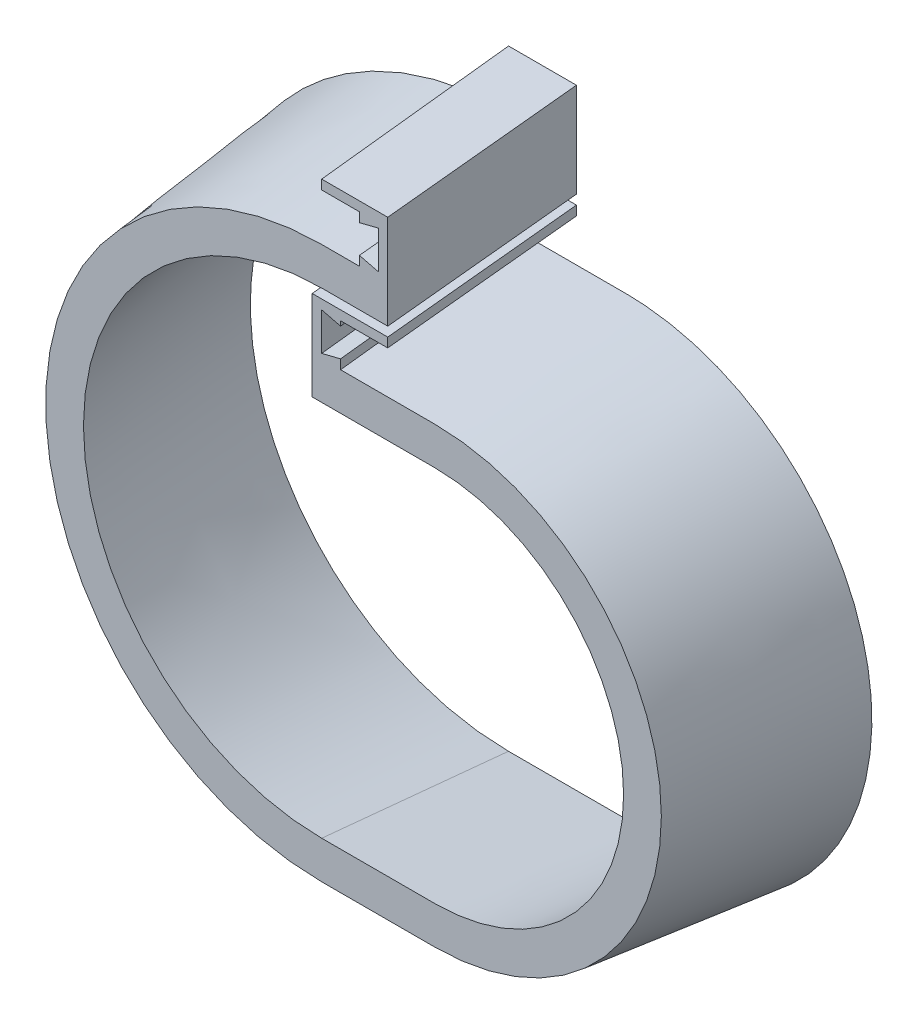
ISO-10303-21;
HEADER;
FILE_DESCRIPTION(('STEP AP214'),'2;1');
FILE_NAME('part.step','',(''),(''),'','','');
FILE_SCHEMA(('AUTOMOTIVE_DESIGN { 1 0 10303 214 1 1 1 1 }'));
ENDSEC;
DATA;
#1=APPLICATION_CONTEXT('core data for automotive mechanical design processes');
#2=APPLICATION_PROTOCOL_DEFINITION('international standard','automotive_design',2000,#1);
#3=PRODUCT_CONTEXT('',#1,'mechanical');
#4=PRODUCT('Part','Part','',(#3));
#5=PRODUCT_RELATED_PRODUCT_CATEGORY('part','',(#4));
#6=PRODUCT_DEFINITION_FORMATION('','',#4);
#7=PRODUCT_DEFINITION_CONTEXT('part definition',#1,'design');
#8=PRODUCT_DEFINITION('design','',#6,#7);
#9=PRODUCT_DEFINITION_SHAPE('','',#8);
#10=(LENGTH_UNIT() NAMED_UNIT(*) SI_UNIT(.MILLI.,.METRE.));
#11=(NAMED_UNIT(*) PLANE_ANGLE_UNIT() SI_UNIT($,.RADIAN.));
#12=(NAMED_UNIT(*) SI_UNIT($,.STERADIAN.) SOLID_ANGLE_UNIT());
#13=UNCERTAINTY_MEASURE_WITH_UNIT(LENGTH_MEASURE(1.E-05),#10,'distance_accuracy_value','');
#14=(GEOMETRIC_REPRESENTATION_CONTEXT(3) GLOBAL_UNCERTAINTY_ASSIGNED_CONTEXT((#13)) GLOBAL_UNIT_ASSIGNED_CONTEXT((#10,
#11,#12)) REPRESENTATION_CONTEXT('',''));
#15=CARTESIAN_POINT('',(0.,0.,0.));
#16=DIRECTION('',(0.,0.,1.));
#17=DIRECTION('',(1.,0.,0.));
#18=AXIS2_PLACEMENT_3D('',#15,#16,#17);
#19=CARTESIAN_POINT('',(0.,56.,-203.2));
#20=CARTESIAN_POINT('',(0.,34.5,0.));
#21=CARTESIAN_POINT('',(-0.666666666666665,56.,-203.2));
#22=CARTESIAN_POINT('',(-0.5,34.5,0.));
#23=CARTESIAN_POINT('',(-1.95951919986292,56.,-203.2));
#24=CARTESIAN_POINT('',(-1.53132183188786,34.5,0.));
#25=CARTESIAN_POINT('',(-3.86961363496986,56.,-203.2));
#26=CARTESIAN_POINT('',(-3.10344979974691,34.5,0.));
#27=CARTESIAN_POINT('',(-5.83110910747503,56.,-203.2));
#28=CARTESIAN_POINT('',(-4.61879209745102,34.5,0.));
#29=CARTESIAN_POINT('',(-7.23747988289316,56.,-203.2));
#30=CARTESIAN_POINT('',(-5.55419157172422,34.5,0.));
#31=CARTESIAN_POINT('',(-11.2976163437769,56.,-203.2));
#32=CARTESIAN_POINT('',(-7.9279559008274,34.5,0.));
#33=CARTESIAN_POINT('',(-17.9045072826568,55.355226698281,-203.2));
#34=CARTESIAN_POINT('',(-11.7770285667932,34.1177097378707,0.));
#35=CARTESIAN_POINT('',(-27.4672579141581,52.4711410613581,-203.2));
#36=CARTESIAN_POINT('',(-17.3100677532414,32.4297006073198,0.));
#37=CARTESIAN_POINT('',(-36.3072574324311,47.7666820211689,-203.2));
#38=CARTESIAN_POINT('',(-22.3943098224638,29.7006248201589,0.));
#39=CARTESIAN_POINT('',(-44.0742715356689,41.4126580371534,-203.2));
#40=CARTESIAN_POINT('',(-26.8404520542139,26.0404419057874,0.));
#41=CARTESIAN_POINT('',(-50.4578361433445,33.6491859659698,-203.2));
#42=CARTESIAN_POINT('',(-30.4841929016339,21.5920785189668,0.));
#43=CARTESIAN_POINT('',(-55.2015763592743,24.7756063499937,-203.2));
#44=CARTESIAN_POINT('',(-33.1914772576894,16.525871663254,0.));
#45=CARTESIAN_POINT('',(-58.1146751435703,15.1383684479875,-203.2));
#46=CARTESIAN_POINT('',(-34.8628625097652,11.0335745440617,0.));
#47=CARTESIAN_POINT('',(-59.0806329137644,5.1160987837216,-203.2));
#48=CARTESIAN_POINT('',(-35.4365865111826,5.32185405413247,0.));
#49=CARTESIAN_POINT('',(-58.0624425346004,-4.89666700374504,-203.2));
#50=CARTESIAN_POINT('',(-34.8906145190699,-0.39478979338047,0.));
#51=CARTESIAN_POINT('',(-55.1041346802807,-14.5066198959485,-203.2));
#52=CARTESIAN_POINT('',(-33.2434273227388,-5.90127585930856,0.));
#53=CARTESIAN_POINT('',(-50.3284516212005,-23.3386832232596,-203.2));
#54=CARTESIAN_POINT('',(-30.5535593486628,-10.9892239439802,0.));
#55=CARTESIAN_POINT('',(-43.9309687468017,-31.0519318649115,-203.2));
#56=CARTESIAN_POINT('',(-26.9178809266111,-15.4641754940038,0.));
#57=CARTESIAN_POINT('',(-36.1707708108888,-37.3539503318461,-203.2));
#58=CARTESIAN_POINT('',(-22.4687800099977,-19.1522824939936,0.));
#59=CARTESIAN_POINT('',(-27.3586245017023,-42.0122708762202,-203.2));
#60=CARTESIAN_POINT('',(-17.3700432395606,-21.9065785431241,0.));
#61=CARTESIAN_POINT('',(-17.8425168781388,-44.8636253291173,-203.2));
#62=CARTESIAN_POINT('',(-11.8117532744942,-23.612870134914,0.));
#63=CARTESIAN_POINT('',(-11.2761364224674,-45.5,-203.2));
#64=CARTESIAN_POINT('',(-7.94009975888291,-24.,0.));
#65=CARTESIAN_POINT('',(-6.4848935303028,-45.5,-203.2));
#66=CARTESIAN_POINT('',(-5.10276700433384,-24.,0.));
#67=CARTESIAN_POINT('',(-3.80022649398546,-45.5,-203.2));
#68=CARTESIAN_POINT('',(-3.16412231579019,-24.,0.));
#69=CARTESIAN_POINT('',(-0.0644247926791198,-45.5,-203.2));
#70=CARTESIAN_POINT('',(0.0762154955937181,-24.0000000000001,0.));
#71=CARTESIAN_POINT('',(3.69529819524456,-45.5,-203.2));
#72=CARTESIAN_POINT('',(3.26436056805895,-24.,0.));
#73=CARTESIAN_POINT('',(6.42740203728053,-45.5,-203.2));
#74=CARTESIAN_POINT('',(5.13527031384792,-24.,0.));
#75=CARTESIAN_POINT('',(10.9181518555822,-45.5,-203.2));
#76=CARTESIAN_POINT('',(7.60461389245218,-24.,0.));
#77=CARTESIAN_POINT('',(16.7762945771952,-44.9368037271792,-203.2));
#78=CARTESIAN_POINT('',(10.7996832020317,-23.6763848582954,0.));
#79=CARTESIAN_POINT('',(25.2927268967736,-42.3983416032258,-203.200000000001));
#80=CARTESIAN_POINT('',(15.3718957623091,-22.2667666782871,0.));
#81=CARTESIAN_POINT('',(33.2012781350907,-38.2339722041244,-203.2));
#82=CARTESIAN_POINT('',(19.5482487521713,-19.9952397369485,0.));
#83=CARTESIAN_POINT('',(40.1811250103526,-32.5814656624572,-203.2));
#84=CARTESIAN_POINT('',(23.1885771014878,-16.9724940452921,0.));
#85=CARTESIAN_POINT('',(45.942967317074,-25.6455470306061,-203.2));
#86=CARTESIAN_POINT('',(26.1527157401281,-13.3092196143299,0.));
#87=CARTESIAN_POINT('',(50.2440905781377,-17.6899611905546,-203.2));
#88=CARTESIAN_POINT('',(28.3513663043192,-9.15585541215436,0.));
#89=CARTESIAN_POINT('',(52.90105255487,-9.02634100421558,-203.2));
#90=CARTESIAN_POINT('',(29.6952304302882,-4.66284040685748,0.));
#91=CARTESIAN_POINT('',(53.799637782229,0.,-203.2));
#92=CARTESIAN_POINT('',(30.1534658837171,0.,0.));
#93=CARTESIAN_POINT('',(52.9010525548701,9.02634100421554,-203.2));
#94=CARTESIAN_POINT('',(29.6952304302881,4.6628404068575,0.));
#95=CARTESIAN_POINT('',(50.2440905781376,17.6899611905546,-203.2));
#96=CARTESIAN_POINT('',(28.3513663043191,9.15585541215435,0.));
#97=CARTESIAN_POINT('',(45.9429673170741,25.645547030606,-203.2));
#98=CARTESIAN_POINT('',(26.1527157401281,13.30921961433,0.));
#99=CARTESIAN_POINT('',(40.1811250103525,32.5814656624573,-203.2));
#100=CARTESIAN_POINT('',(23.1885771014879,16.9724940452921,0.));
#101=CARTESIAN_POINT('',(33.2012781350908,38.2339722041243,-203.2));
#102=CARTESIAN_POINT('',(19.5482487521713,19.9952397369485,0.));
#103=CARTESIAN_POINT('',(25.2927268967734,42.398341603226,-203.2));
#104=CARTESIAN_POINT('',(15.371895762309,22.266766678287,0.));
#105=CARTESIAN_POINT('',(16.7762945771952,44.9368037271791,-203.2));
#106=CARTESIAN_POINT('',(10.7996832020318,23.6763848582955,0.));
#107=CARTESIAN_POINT('',(10.9181518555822,45.5,-203.2));
#108=CARTESIAN_POINT('',(7.6046138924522,24.,0.));
#109=CARTESIAN_POINT('',(6.42740203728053,45.5,-203.2));
#110=CARTESIAN_POINT('',(5.13527031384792,24.,0.));
#111=CARTESIAN_POINT('',(3.5916079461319,45.5,-203.2));
#112=CARTESIAN_POINT('',(3.30303911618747,24.,0.));
#113=CARTESIAN_POINT('',(-0.313106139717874,45.5,-203.2));
#114=CARTESIAN_POINT('',(0.269867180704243,24.,0.));
#115=CARTESIAN_POINT('',(-4.09714466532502,45.5,-203.2));
#116=CARTESIAN_POINT('',(-2.9186453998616,24.,0.));
#117=CARTESIAN_POINT('',(-6.66666666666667,45.5,-203.2));
#118=CARTESIAN_POINT('',(-5.,24.,0.));
#119=CARTESIAN_POINT('',(-8.,45.5,-203.2));
#120=CARTESIAN_POINT('',(-6.,24.,0.));
#121=B_SPLINE_SURFACE_WITH_KNOTS('',3,1,((#19,#20),(#21,#22),(#23,#24),(#25,#26),(#27,#28),(#29,
#30),(#31,#32),(#33,#34),(#35,#36),(#37,#38),(#39,#40),(#41,#42),(#43,#44),(#45,#46),(#47,#48),
(#49,#50),(#51,#52),(#53,#54),(#55,#56),(#57,#58),(#59,#60),(#61,#62),(#63,#64),(#65,#66),(#67,
#68),(#69,#70),(#71,#72),(#73,#74),(#75,#76),(#77,#78),(#79,#80),(#81,#82),(#83,#84),(#85,#86),
(#87,#88),(#89,#90),(#91,#92),(#93,#94),(#95,#96),(#97,#98),(#99,#100),(#101,#102),(#103,#104),
(#105,#106),(#107,#108),(#109,#110),(#111,#112),(#113,#114),(#115,#116),(#117,#118),(#119,
#120)),.UNSPECIFIED.,.F.,.F.,.F.,(4,1,1,1,2,1,1,1,1,1,1,1,1,1,1,1,1,1,1,1,2,1,1,1,2,1,1,1,1,1,1,
1,1,1,1,1,1,1,1,1,2,1,1,1,4),(2,2),(0.,0.00673065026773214,0.0134613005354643,
0.0201919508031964,0.0269226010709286,0.0560301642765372,0.0851377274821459,0.114245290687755,
0.143352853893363,0.172460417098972,0.201567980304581,0.230675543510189,0.259783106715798,
0.288890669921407,0.317998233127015,0.347105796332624,0.376213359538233,0.405320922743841,
0.43442848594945,0.463536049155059,0.492643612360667,0.506104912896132,0.519566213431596,
0.53302751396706,0.546488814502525,0.571467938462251,0.596447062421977,0.621426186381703,
0.646405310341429,0.671384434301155,0.696363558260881,0.721342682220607,0.746321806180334,
0.77130093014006,0.796280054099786,0.821259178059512,0.846238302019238,0.871217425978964,
0.89619654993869,0.921175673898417,0.946154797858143,0.959616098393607,0.973077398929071,
0.986538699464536,1.),(0.,1.),.UNSPECIFIED.);
#122=DIRECTION('',(0.,-0.10521975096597,0.994448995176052));
#123=VECTOR('',#122,1.);
#124=CARTESIAN_POINT('',(-2.,56.,-203.2));
#125=LINE('',#124,#123);
#126=CARTESIAN_POINT('',(-2.,36.6161417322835,-20.));
#127=VERTEX_POINT('',#126);
#128=CARTESIAN_POINT('',(-2.,34.5,0.));
#129=VERTEX_POINT('',#128);
#130=EDGE_CURVE('E720',#127,#129,#125,.T.);
#131=CARTESIAN_POINT('',(-0.316576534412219,36.6161417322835,-20.));
#132=CARTESIAN_POINT('',(-0.764059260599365,36.6161417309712,-20.));
#133=CARTESIAN_POINT('',(-1.21154198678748,36.6161417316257,-20.));
#134=CARTESIAN_POINT('',(-2.10882715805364,36.6161417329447,-20.));
#135=CARTESIAN_POINT('',(-2.55862960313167,36.6161417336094,-20.));
#136=CARTESIAN_POINT('',(-3.2341021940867,36.6161417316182,-20.));
#137=CARTESIAN_POINT('',(-3.45977233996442,36.616141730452,-20.));
#138=CARTESIAN_POINT('',(-3.91111270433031,36.6161417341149,-20.));
#139=CARTESIAN_POINT('',(-4.13678292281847,36.6161417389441,-20.));
#140=CARTESIAN_POINT('',(-4.47547505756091,36.6161417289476,-20.));
#141=CARTESIAN_POINT('',(-4.58849697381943,36.6161417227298,-20.));
#142=CARTESIAN_POINT('',(-4.81454069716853,36.6161417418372,-20.));
#143=CARTESIAN_POINT('',(-4.92756250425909,36.6161417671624,-20.));
#144=CARTESIAN_POINT('',(-5.15361050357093,36.6161416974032,-20.));
#145=CARTESIAN_POINT('',(-5.26663669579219,36.6161416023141,-20.));
#146=CARTESIAN_POINT('',(-5.49268945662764,36.6161418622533,-20.));
#147=CARTESIAN_POINT('',(-5.60571602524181,36.616142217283,-20.));
#148=CARTESIAN_POINT('',(-5.77525765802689,36.6161414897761,-20.));
#149=CARTESIAN_POINT('',(-5.83177272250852,36.6161410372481,-20.));
#150=CARTESIAN_POINT('',(-5.94480285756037,36.6161424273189,-20.));
#151=CARTESIAN_POINT('',(-6.00131792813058,36.6161442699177,-20.));
#152=CARTESIAN_POINT('',(-6.08609039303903,36.6161404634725,-20.));
#153=CARTESIAN_POINT('',(-6.11434778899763,36.616138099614,-20.));
#154=CARTESIAN_POINT('',(-6.17086258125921,36.6161453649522,-20.));
#155=CARTESIAN_POINT('',(-6.1991199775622,36.6161549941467,-20.));
#156=CARTESIAN_POINT('',(-6.28389183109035,36.6160705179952,-20.));
#157=CARTESIAN_POINT('',(-6.34040625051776,36.6158630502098,-20.));
#158=CARTESIAN_POINT('',(-6.45342876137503,36.6151408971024,-20.));
#159=CARTESIAN_POINT('',(-6.50993685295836,36.6146262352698,-20.));
#160=CARTESIAN_POINT('',(-6.62294967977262,36.6132912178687,-20.));
#161=CARTESIAN_POINT('',(-6.6794544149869,36.6124708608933,-20.));
#162=CARTESIAN_POINT('',(-6.84896091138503,36.6095509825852,-20.));
#163=CARTESIAN_POINT('',(-6.96195485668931,36.6069926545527,-20.));
#164=CARTESIAN_POINT('',(-7.30219257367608,36.5974478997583,-20.));
#165=CARTESIAN_POINT('',(-7.52938684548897,36.5885999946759,-20.));
#166=CARTESIAN_POINT('',(-7.98354838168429,36.565968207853,-20.));
#167=CARTESIAN_POINT('',(-8.21051562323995,36.5521838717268,-20.));
#168=CARTESIAN_POINT('',(-8.66359575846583,36.5197255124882,-20.));
#169=CARTESIAN_POINT('',(-8.88970943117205,36.5010623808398,-20.));
#170=CARTESIAN_POINT('',(-9.34146998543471,36.4588434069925,-20.));
#171=CARTESIAN_POINT('',(-9.56711688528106,36.435287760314,-20.));
#172=CARTESIAN_POINT('',(-10.0175160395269,36.3833315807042,-20.));
#173=CARTESIAN_POINT('',(-10.242269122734,36.3549382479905,-20.));
#174=CARTESIAN_POINT('',(-10.6911072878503,36.2932938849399,-20.));
#175=CARTESIAN_POINT('',(-10.9151923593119,36.2600427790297,-20.));
#176=CARTESIAN_POINT('',(-11.5859244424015,36.1530732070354,-20.));
#177=CARTESIAN_POINT('',(-12.0314383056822,36.072093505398,-20.));
#178=CARTESIAN_POINT('',(-12.9184563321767,35.8908826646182,-20.));
#179=CARTESIAN_POINT('',(-13.3599609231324,35.7906536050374,-20.));
#180=CARTESIAN_POINT('',(-14.3698073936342,35.5383046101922,-20.));
#181=CARTESIAN_POINT('',(-14.936526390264,35.3796343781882,-20.));
#182=CARTESIAN_POINT('',(-16.0607943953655,35.0305402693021,-20.));
#183=CARTESIAN_POINT('',(-16.6183321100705,34.840080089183,-20.));
#184=CARTESIAN_POINT('',(-17.7219663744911,34.4279894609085,-20.));
#185=CARTESIAN_POINT('',(-18.2680594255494,34.2063496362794,-20.));
#186=CARTESIAN_POINT('',(-19.3452548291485,33.7333177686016,-20.));
#187=CARTESIAN_POINT('',(-19.8763970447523,33.4820164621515,-20.));
#188=CARTESIAN_POINT('',(-20.9235269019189,32.9501577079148,-20.));
#189=CARTESIAN_POINT('',(-21.4395213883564,32.6696137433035,-20.));
#190=CARTESIAN_POINT('',(-22.454887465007,32.0801038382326,-20.));
#191=CARTESIAN_POINT('',(-22.954261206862,31.7711415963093,-20.));
#192=CARTESIAN_POINT('',(-24.180634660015,30.9637723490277,-20.));
#193=CARTESIAN_POINT('',(-24.8963009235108,30.448016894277,-20.));
#194=CARTESIAN_POINT('',(-26.2818701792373,29.3580643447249,-20.));
#195=CARTESIAN_POINT('',(-26.9517659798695,28.783858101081,-20.));
#196=CARTESIAN_POINT('',(-27.9188393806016,27.8815437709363,-20.));
#197=CARTESIAN_POINT('',(-28.2351200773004,27.573697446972,-20.));
#198=CARTESIAN_POINT('',(-28.8543692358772,26.9449094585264,-20.));
#199=CARTESIAN_POINT('',(-29.1573376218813,26.6239677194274,-20.));
#200=CARTESIAN_POINT('',(-30.0455117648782,25.6424105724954,-20.));
#201=CARTESIAN_POINT('',(-30.6101651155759,24.9628964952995,-20.));
#202=CARTESIAN_POINT('',(-31.4124132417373,23.9102359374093,-20.));
#203=CARTESIAN_POINT('',(-31.6723444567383,23.5538305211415,-20.));
#204=CARTESIAN_POINT('',(-32.1769267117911,22.8303496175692,-20.));
#205=CARTESIAN_POINT('',(-32.4215777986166,22.4632741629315,-20.));
#206=CARTESIAN_POINT('',(-33.1319222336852,21.347056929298,-20.));
#207=CARTESIAN_POINT('',(-33.5741177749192,20.5827785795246,-20.));
#208=CARTESIAN_POINT('',(-34.3924424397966,19.0202035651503,-20.));
#209=CARTESIAN_POINT('',(-34.7686024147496,18.2219230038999,-20.));
#210=CARTESIAN_POINT('',(-35.4521764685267,16.5964546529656,-20.));
#211=CARTESIAN_POINT('',(-35.7595908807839,15.7692670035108,-20.));
#212=CARTESIAN_POINT('',(-36.3037557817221,14.0920246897,-20.));
#213=CARTESIAN_POINT('',(-36.5405186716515,13.2419740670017,-20.));
#214=CARTESIAN_POINT('',(-36.841297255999,11.9544139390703,-20.));
#215=CARTESIAN_POINT('',(-36.9325029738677,11.5230976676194,-20.));
#216=CARTESIAN_POINT('',(-37.0966103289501,10.6570078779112,-20.));
#217=CARTESIAN_POINT('',(-37.1695119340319,10.2222343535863,-20.));
#218=CARTESIAN_POINT('',(-37.3606600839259,8.91373353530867,-20.));
#219=CARTESIAN_POINT('',(-37.4513658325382,8.0357579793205,-20.));
#220=CARTESIAN_POINT('',(-37.5317894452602,6.71575297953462,-20.));
#221=CARTESIAN_POINT('',(-37.5493236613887,6.27519485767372,-20.));
#222=CARTESIAN_POINT('',(-37.5657714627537,5.39372050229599,-20.));
#223=CARTESIAN_POINT('',(-37.5646851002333,4.95280426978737,-20.));
#224=CARTESIAN_POINT('',(-37.533502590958,3.63065344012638,-20.));
#225=CARTESIAN_POINT('',(-37.4754887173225,2.7499230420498,-20.));
#226=CARTESIAN_POINT('',(-37.2856439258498,0.996554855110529,-20.));
#227=CARTESIAN_POINT('',(-37.1538129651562,0.123917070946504,-20.));
#228=CARTESIAN_POINT('',(-36.8169407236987,-1.60707687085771,-20.));
#229=CARTESIAN_POINT('',(-36.6119022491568,-2.46543357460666,-20.));
#230=CARTESIAN_POINT('',(-36.1303559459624,-4.16196236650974,-20.));
#231=CARTESIAN_POINT('',(-35.8538482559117,-5.00013449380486,-20.));
#232=CARTESIAN_POINT('',(-35.3868597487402,-6.23768340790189,-20.));
#233=CARTESIAN_POINT('',(-35.2224261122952,-6.64705382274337,-20.));
#234=CARTESIAN_POINT('',(-34.8764081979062,-7.45846928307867,-20.));
#235=CARTESIAN_POINT('',(-34.6948238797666,-7.8605143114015,-20.));
#236=CARTESIAN_POINT('',(-34.1248727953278,-9.05465903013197,-20.));
#237=CARTESIAN_POINT('',(-33.7112404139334,-9.83494703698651,-20.));
#238=CARTESIAN_POINT('',(-33.0428411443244,-10.9768681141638,-20.));
#239=CARTESIAN_POINT('',(-32.8120313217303,-11.3527826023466,-20.));
#240=CARTESIAN_POINT('',(-32.3347259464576,-12.0945308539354,-20.));
#241=CARTESIAN_POINT('',(-32.088230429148,-12.4603646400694,-20.));
#242=CARTESIAN_POINT('',(-31.3259396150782,-13.5417094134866,-20.));
#243=CARTESIAN_POINT('',(-30.7872282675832,-14.241254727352,-20.));
#244=CARTESIAN_POINT('',(-29.6533938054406,-15.5919619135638,-20.));
#245=CARTESIAN_POINT('',(-29.0583150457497,-16.2431611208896,-20.));
#246=CARTESIAN_POINT('',(-27.8152653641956,-17.4930640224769,-20.));
#247=CARTESIAN_POINT('',(-27.1672898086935,-18.0917631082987,-20.));
#248=CARTESIAN_POINT('',(-25.8226621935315,-19.2331409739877,-20.));
#249=CARTESIAN_POINT('',(-25.1259691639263,-19.7757716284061,-20.));
#250=CARTESIAN_POINT('',(-24.0487470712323,-20.544021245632,-20.));
#251=CARTESIAN_POINT('',(-23.684311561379,-20.7924870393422,-20.));
#252=CARTESIAN_POINT('',(-22.9452719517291,-21.2737911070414,-20.));
#253=CARTESIAN_POINT('',(-22.5706684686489,-21.506630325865,-20.));
#254=CARTESIAN_POINT('',(-21.6849109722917,-22.0316414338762,-20.));
#255=CARTESIAN_POINT('',(-21.1700417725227,-22.3175683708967,-20.));
#256=CARTESIAN_POINT('',(-20.1249568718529,-22.8601041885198,-20.));
#257=CARTESIAN_POINT('',(-19.5947379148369,-23.1167067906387,-20.));
#258=CARTESIAN_POINT('',(-18.5202569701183,-23.5998071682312,-20.));
#259=CARTESIAN_POINT('',(-17.9759843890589,-23.8262813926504,-20.));
#260=CARTESIAN_POINT('',(-16.8775343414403,-24.247402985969,-20.));
#261=CARTESIAN_POINT('',(-16.3234001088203,-24.4421631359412,-20.));
#262=CARTESIAN_POINT('',(-15.2053746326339,-24.8002476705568,-20.));
#263=CARTESIAN_POINT('',(-14.6414882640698,-24.9635872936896,-20.));
#264=CARTESIAN_POINT('',(-13.5064419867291,-25.258136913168,-20.));
#265=CARTESIAN_POINT('',(-12.9352972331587,-25.3894050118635,-20.));
#266=CARTESIAN_POINT('',(-12.10343996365,-25.556137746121,-20.));
#267=CARTESIAN_POINT('',(-11.8452553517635,-25.6045100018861,-20.));
#268=CARTESIAN_POINT('',(-11.3277503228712,-25.6947466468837,-20.));
#269=CARTESIAN_POINT('',(-11.0684299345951,-25.7366111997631,-20.));
#270=CARTESIAN_POINT('',(-10.5487596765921,-25.8138244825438,-20.));
#271=CARTESIAN_POINT('',(-10.2884095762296,-25.8491716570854,-20.));
#272=CARTESIAN_POINT('',(-9.76689184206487,-25.9133237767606,-20.));
#273=CARTESIAN_POINT('',(-9.50572416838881,-25.942128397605,-20.));
#274=CARTESIAN_POINT('',(-8.98243733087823,-25.9932072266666,-20.));
#275=CARTESIAN_POINT('',(-8.72031740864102,-26.0154737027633,-20.));
#276=CARTESIAN_POINT('',(-8.32680089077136,-26.0439278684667,-20.));
#277=CARTESIAN_POINT('',(-8.19557858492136,-26.0525880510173,-20.));
#278=CARTESIAN_POINT('',(-7.9330329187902,-26.0682588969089,-20.));
#279=CARTESIAN_POINT('',(-7.80170955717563,-26.0752695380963,-20.));
#280=CARTESIAN_POINT('',(-7.53871459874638,-26.0876519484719,-20.));
#281=CARTESIAN_POINT('',(-7.40704284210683,-26.0930203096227,-20.));
#282=CARTESIAN_POINT('',(-7.14364551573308,-26.1020960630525,-20.));
#283=CARTESIAN_POINT('',(-7.01191994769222,-26.1058035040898,-20.));
#284=CARTESIAN_POINT('',(-6.81429803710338,-26.1101190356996,-20.));
#285=CARTESIAN_POINT('',(-6.74841473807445,-26.1113499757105,-20.));
#286=CARTESIAN_POINT('',(-6.61664213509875,-26.1133941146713,-20.));
#287=CARTESIAN_POINT('',(-6.55075283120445,-26.1142073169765,-20.));
#288=CARTESIAN_POINT('',(-6.41896841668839,-26.1154245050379,-20.));
#289=CARTESIAN_POINT('',(-6.35307330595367,-26.1158284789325,-20.));
#290=CARTESIAN_POINT('',(-6.22128167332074,-26.1161941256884,-20.));
#291=CARTESIAN_POINT('',(-6.15538515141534,-26.1161557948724,-20.));
#292=CARTESIAN_POINT('',(-6.02357789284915,-26.1161276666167,-20.));
#293=CARTESIAN_POINT('',(-5.95766715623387,-26.1161378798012,-20.));
#294=CARTESIAN_POINT('',(-5.82584586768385,-26.1161455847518,-20.));
#295=CARTESIAN_POINT('',(-5.75993531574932,-26.1161430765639,-20.));
#296=CARTESIAN_POINT('',(-5.56220522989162,-26.1161390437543,-20.));
#297=CARTESIAN_POINT('',(-5.43038571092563,-26.1161410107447,-20.));
#298=CARTESIAN_POINT('',(-5.1667521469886,-26.1161424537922,-20.));
#299=CARTESIAN_POINT('',(-5.03493810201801,-26.1161419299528,-20.));
#300=CARTESIAN_POINT('',(-4.77130953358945,-26.1161415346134,-20.));
#301=CARTESIAN_POINT('',(-4.6394950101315,-26.1161416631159,-20.));
#302=CARTESIAN_POINT('',(-4.24153502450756,-26.1161418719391,-20.));
#303=CARTESIAN_POINT('',(-3.97538956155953,-26.1161417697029,-20.));
#304=CARTESIAN_POINT('',(-3.4430953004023,-26.1161416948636,-20.));
#305=CARTESIAN_POINT('',(-3.17694650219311,-26.1161417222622,-20.));
#306=CARTESIAN_POINT('',(-2.64499604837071,-26.1161417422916,-20.));
#307=CARTESIAN_POINT('',(-2.37919439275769,-26.1161417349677,-20.));
#308=CARTESIAN_POINT('',(-1.84759198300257,-26.1161417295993,-20.));
#309=CARTESIAN_POINT('',(-1.58179122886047,-26.1161417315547,-20.));
#310=CARTESIAN_POINT('',(-1.05035610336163,-26.1161417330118,-20.));
#311=CARTESIAN_POINT('',(-0.78472173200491,-26.116141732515,-20.));
#312=CARTESIAN_POINT('',(-0.25345271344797,-26.116141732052,-20.));
#313=CARTESIAN_POINT('',(0.012181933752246,-26.1161417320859,-20.));
#314=CARTESIAN_POINT('',(0.809110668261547,-26.1161417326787,-20.));
#315=CARTESIAN_POINT('',(1.34040475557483,-26.1161417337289,-20.));
#316=CARTESIAN_POINT('',(2.13753738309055,-26.1161417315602,-20.));
#317=CARTESIAN_POINT('',(2.40337592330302,-26.1161417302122,-20.));
#318=CARTESIAN_POINT('',(2.93505353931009,-26.1161417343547,-20.));
#319=CARTESIAN_POINT('',(3.20089261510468,-26.1161417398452,-20.));
#320=CARTESIAN_POINT('',(3.64429588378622,-26.1161417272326,-20.));
#321=CARTESIAN_POINT('',(3.82186007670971,-26.1161417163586,-20.));
#322=CARTESIAN_POINT('',(4.17698732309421,-26.1161417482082,-20.));
#323=CARTESIAN_POINT('',(4.35455037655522,-26.1161417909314,-20.));
#324=CARTESIAN_POINT('',(4.70972031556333,-26.116141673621,-20.));
#325=CARTESIAN_POINT('',(4.88732720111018,-26.1161415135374,-20.));
#326=CARTESIAN_POINT('',(5.15373966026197,-26.1161418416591,-20.));
#327=CARTESIAN_POINT('',(5.24254523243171,-26.1161420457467,-20.));
#328=CARTESIAN_POINT('',(5.42015616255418,-26.116141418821,-20.));
#329=CARTESIAN_POINT('',(5.50896152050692,-26.1161405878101,-20.));
#330=CARTESIAN_POINT('',(5.68654020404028,-26.1161428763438,-20.));
#331=CARTESIAN_POINT('',(5.7753135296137,-26.1161459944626,-20.));
#332=CARTESIAN_POINT('',(5.9528608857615,-26.1161374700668,-20.));
#333=CARTESIAN_POINT('',(6.04163491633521,-26.1161258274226,-20.));
#334=CARTESIAN_POINT('',(6.17479456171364,-26.1161496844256,-20.));
#335=CARTESIAN_POINT('',(6.21918007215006,-26.1161645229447,-20.));
#336=CARTESIAN_POINT('',(6.30795041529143,-26.1159476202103,-20.));
#337=CARTESIAN_POINT('',(6.35233524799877,-26.1157158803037,-20.));
#338=CARTESIAN_POINT('',(6.44110230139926,-26.1150302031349,-20.));
#339=CARTESIAN_POINT('',(6.48548452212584,-26.1145762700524,-20.));
#340=CARTESIAN_POINT('',(6.5742462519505,-26.1134398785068,-20.));
#341=CARTESIAN_POINT('',(6.61862576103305,-26.1127574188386,-20.));
#342=CARTESIAN_POINT('',(6.75167735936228,-26.1103712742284,-20.));
#343=CARTESIAN_POINT('',(6.84034360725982,-26.1083281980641,-20.));
#344=CARTESIAN_POINT('',(7.01765206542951,-26.1033362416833,-20.));
#345=CARTESIAN_POINT('',(7.1062942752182,-26.1003873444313,-20.));
#346=CARTESIAN_POINT('',(7.28354857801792,-26.093584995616,-20.));
#347=CARTESIAN_POINT('',(7.37216066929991,-26.0897314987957,-20.));
#348=CARTESIAN_POINT('',(7.54933981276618,-26.0811211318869,-20.));
#349=CARTESIAN_POINT('',(7.63790686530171,-26.0763642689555,-20.));
#350=CARTESIAN_POINT('',(7.90352681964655,-26.0607403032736,-20.));
#351=CARTESIAN_POINT('',(8.08050246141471,-26.0485196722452,-20.));
#352=CARTESIAN_POINT('',(8.4341607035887,-26.0204793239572,-20.));
#353=CARTESIAN_POINT('',(8.61084330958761,-26.0046596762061,-20.));
#354=CARTESIAN_POINT('',(9.13569252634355,-25.9522800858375,-20.));
#355=CARTESIAN_POINT('',(9.48335565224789,-25.910521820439,-20.));
#356=CARTESIAN_POINT('',(10.1771551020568,-25.8130369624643,-20.));
#357=CARTESIAN_POINT('',(10.523288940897,-25.7572927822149,-20.));
#358=CARTESIAN_POINT('',(11.2133027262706,-25.6318854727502,-20.));
#359=CARTESIAN_POINT('',(11.5571807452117,-25.5622117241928,-20.));
#360=CARTESIAN_POINT('',(12.2419504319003,-25.4090628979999,-20.));
#361=CARTESIAN_POINT('',(12.5828412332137,-25.3255839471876,-20.));
#362=CARTESIAN_POINT('',(13.2609202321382,-25.1450028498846,-20.));
#363=CARTESIAN_POINT('',(13.5981091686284,-25.0479034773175,-20.));
#364=CARTESIAN_POINT('',(14.2828000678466,-24.8357132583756,-20.));
#365=CARTESIAN_POINT('',(14.6301173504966,-24.7200259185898,-20.));
#366=CARTESIAN_POINT('',(15.3193612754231,-24.4741997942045,-20.));
#367=CARTESIAN_POINT('',(15.6612910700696,-24.3440698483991,-20.));
#368=CARTESIAN_POINT('',(16.339222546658,-24.0694907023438,-20.));
#369=CARTESIAN_POINT('',(16.6752261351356,-23.9250462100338,-20.));
#370=CARTESIAN_POINT('',(17.340820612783,-23.6221106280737,-20.));
#371=CARTESIAN_POINT('',(17.6704117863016,-23.4636201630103,-20.));
#372=CARTESIAN_POINT('',(18.3254334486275,-23.1315310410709,-20.));
#373=CARTESIAN_POINT('',(18.6508044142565,-22.9578149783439,-20.));
#374=CARTESIAN_POINT('',(19.2939900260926,-22.5967660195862,-20.));
#375=CARTESIAN_POINT('',(19.6118030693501,-22.4094302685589,-20.));
#376=CARTESIAN_POINT('',(20.2392902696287,-22.0215040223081,-20.));
#377=CARTESIAN_POINT('',(20.5489634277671,-21.8209119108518,-20.));
#378=CARTESIAN_POINT('',(21.1595813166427,-21.4068507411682,-20.));
#379=CARTESIAN_POINT('',(21.4605257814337,-21.1933812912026,-20.));
#380=CARTESIAN_POINT('',(22.1509028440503,-20.6814511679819,-20.));
#381=CARTESIAN_POINT('',(22.5367835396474,-20.3781801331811,-20.));
#382=CARTESIAN_POINT('',(23.2908408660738,-19.7504647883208,-20.));
#383=CARTESIAN_POINT('',(23.6590192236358,-19.4260225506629,-20.));
#384=CARTESIAN_POINT('',(24.3763982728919,-18.7568250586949,-20.));
#385=CARTESIAN_POINT('',(24.7256001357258,-18.4120710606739,-20.));
#386=CARTESIAN_POINT('',(25.4027299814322,-17.7044404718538,-20.));
#387=CARTESIAN_POINT('',(25.7307239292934,-17.3416269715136,-20.));
#388=CARTESIAN_POINT('',(26.3658453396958,-16.5981229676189,-20.));
#389=CARTESIAN_POINT('',(26.6729714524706,-16.2174313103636,-20.));
#390=CARTESIAN_POINT('',(27.2654316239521,-15.4394834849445,-20.));
#391=CARTESIAN_POINT('',(27.5507647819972,-15.0422266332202,-20.));
#392=CARTESIAN_POINT('',(28.2356855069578,-14.0300440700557,-20.));
#393=CARTESIAN_POINT('',(28.6211934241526,-13.4054654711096,-20.));
#394=CARTESIAN_POINT('',(29.1590407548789,-12.4462654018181,-20.));
#395=CARTESIAN_POINT('',(29.3316000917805,-12.122782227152,-20.));
#396=CARTESIAN_POINT('',(29.6629660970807,-11.468821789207,-20.));
#397=CARTESIAN_POINT('',(29.8217730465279,-11.1383446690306,-20.));
#398=CARTESIAN_POINT('',(30.1254282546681,-10.4706110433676,-20.));
#399=CARTESIAN_POINT('',(30.2702613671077,-10.1333476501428,-20.));
#400=CARTESIAN_POINT('',(30.5454417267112,-9.45298450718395,-20.));
#401=CARTESIAN_POINT('',(30.6757888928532,-9.10988472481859,-20.));
#402=CARTESIAN_POINT('',(31.0448960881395,-8.07277439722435,-20.));
#403=CARTESIAN_POINT('',(31.2617767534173,-7.37083191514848,-20.));
#404=CARTESIAN_POINT('',(31.6358364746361,-5.95141227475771,-20.));
#405=CARTESIAN_POINT('',(31.7930224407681,-5.23393692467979,-20.));
#406=CARTESIAN_POINT('',(32.0467116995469,-3.78832728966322,-20.));
#407=CARTESIAN_POINT('',(32.1432163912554,-3.06019325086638,-20.));
#408=CARTESIAN_POINT('',(32.2746598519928,-1.59850555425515,-20.));
#409=CARTESIAN_POINT('',(32.3096093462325,-0.864952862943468,-20.));
#410=CARTESIAN_POINT('',(32.3170298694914,0.602466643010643,-20.));
#411=CARTESIAN_POINT('',(32.2895012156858,1.3363334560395,-20.));
#412=CARTESIAN_POINT('',(32.1727557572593,2.79940746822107,-20.));
#413=CARTESIAN_POINT('',(32.0835158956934,3.5286128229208,-20.));
#414=CARTESIAN_POINT('',(31.8442300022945,4.97697430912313,-20.));
#415=CARTESIAN_POINT('',(31.6941820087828,5.69613011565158,-20.));
#416=CARTESIAN_POINT('',(31.3343066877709,7.11922988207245,-20.));
#417=CARTESIAN_POINT('',(31.1244951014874,7.82317779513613,-20.));
#418=CARTESIAN_POINT('',(30.765901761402,8.86377047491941,-20.));
#419=CARTESIAN_POINT('',(30.6390451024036,9.2081089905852,-20.));
#420=CARTESIAN_POINT('',(30.3708165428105,9.89108505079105,-20.));
#421=CARTESIAN_POINT('',(30.2294446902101,10.2297226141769,-20.));
#422=CARTESIAN_POINT('',(29.7838600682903,11.2364391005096,-20.));
#423=CARTESIAN_POINT('',(29.4582273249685,11.8951794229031,-20.));
#424=CARTESIAN_POINT('',(28.7528332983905,13.182950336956,-20.));
#425=CARTESIAN_POINT('',(28.3730683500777,13.8119789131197,-20.));
#426=CARTESIAN_POINT('',(27.5616411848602,15.0367362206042,-20.));
#427=CARTESIAN_POINT('',(27.1299163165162,15.6324234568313,-20.));
#428=CARTESIAN_POINT('',(26.217882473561,16.7853937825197,-20.));
#429=CARTESIAN_POINT('',(25.7375768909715,17.3426795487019,-20.));
#430=CARTESIAN_POINT('',(24.8984922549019,18.236443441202,-20.));
#431=CARTESIAN_POINT('',(24.552288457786,18.5848179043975,-20.));
#432=CARTESIAN_POINT('',(23.8406260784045,19.2613824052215,-20.));
#433=CARTESIAN_POINT('',(23.4751666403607,19.5895715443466,-20.));
#434=CARTESIAN_POINT('',(22.7263408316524,20.2248644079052,-20.));
#435=CARTESIAN_POINT('',(22.3429735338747,20.531967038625,-20.));
#436=CARTESIAN_POINT('',(21.5609874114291,21.1231272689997,-20.));
#437=CARTESIAN_POINT('',(21.1624271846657,21.4072623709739,-20.));
#438=CARTESIAN_POINT('',(20.3500725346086,21.9527953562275,-20.));
#439=CARTESIAN_POINT('',(19.9362788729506,22.2141943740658,-20.));
#440=CARTESIAN_POINT('',(19.0947574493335,22.7134198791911,-20.));
#441=CARTESIAN_POINT('',(18.6670313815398,22.9512492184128,-20.));
#442=CARTESIAN_POINT('',(17.9083484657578,23.3456464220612,-20.));
#443=CARTESIAN_POINT('',(17.5801715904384,23.5075879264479,-20.));
#444=CARTESIAN_POINT('',(16.9172644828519,23.8174988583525,-20.));
#445=CARTESIAN_POINT('',(16.5825340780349,23.9654679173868,-20.));
#446=CARTESIAN_POINT('',(15.9070421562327,24.2471083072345,-20.));
#447=CARTESIAN_POINT('',(15.5662795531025,24.3807770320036,-20.));
#448=CARTESIAN_POINT('',(14.8793056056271,24.6336696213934,-20.));
#449=CARTESIAN_POINT('',(14.5330924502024,24.7528885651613,-20.));
#450=CARTESIAN_POINT('',(13.8331096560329,24.9775816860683,-20.));
#451=CARTESIAN_POINT('',(13.479301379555,25.0829355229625,-20.));
#452=CARTESIAN_POINT('',(12.7675740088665,25.2785731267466,-20.));
#453=CARTESIAN_POINT('',(12.4096552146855,25.3688579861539,-20.));
#454=CARTESIAN_POINT('',(11.6905404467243,25.5341483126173,-20.));
#455=CARTESIAN_POINT('',(11.3293467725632,25.6091637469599,-20.));
#456=CARTESIAN_POINT('',(10.785668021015,25.7101289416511,-20.));
#457=CARTESIAN_POINT('',(10.6042352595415,25.7418422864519,-20.));
#458=CARTESIAN_POINT('',(10.2407400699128,25.8014324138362,-20.));
#459=CARTESIAN_POINT('',(10.0586776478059,25.8293092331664,-20.));
#460=CARTESIAN_POINT('',(9.65706648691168,25.8864716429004,-20.));
#461=CARTESIAN_POINT('',(9.43739514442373,25.9148986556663,-20.));
#462=CARTESIAN_POINT('',(8.99738808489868,25.9661692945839,-20.));
#463=CARTESIAN_POINT('',(8.77705232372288,25.9890125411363,-20.));
#464=CARTESIAN_POINT('',(8.3358845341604,26.0290931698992,-20.));
#465=CARTESIAN_POINT('',(8.11505254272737,26.0463309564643,-20.));
#466=CARTESIAN_POINT('',(7.78355013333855,26.0679698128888,-20.));
#467=CARTESIAN_POINT('',(7.67301345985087,26.0744795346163,-20.));
#468=CARTESIAN_POINT('',(7.45186421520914,26.0860918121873,-20.));
#469=CARTESIAN_POINT('',(7.34125164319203,26.0911943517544,-20.));
#470=CARTESIAN_POINT('',(7.11976515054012,26.0999979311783,-20.));
#471=CARTESIAN_POINT('',(7.00889112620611,26.1036963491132,-20.));
#472=CARTESIAN_POINT('',(6.78710761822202,26.1096766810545,-20.));
#473=CARTESIAN_POINT('',(6.67619813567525,26.1119586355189,-20.));
#474=CARTESIAN_POINT('',(6.50981284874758,26.1143161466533,-20.));
#475=CARTESIAN_POINT('',(6.45434406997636,26.1149244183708,-20.));
#476=CARTESIAN_POINT('',(6.34340345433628,26.1157883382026,-20.));
#477=CARTESIAN_POINT('',(6.28793161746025,26.1160439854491,-20.));
#478=CARTESIAN_POINT('',(6.20472307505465,26.1161539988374,-20.));
#479=CARTESIAN_POINT('',(6.17698644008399,26.1161450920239,-20.));
#480=CARTESIAN_POINT('',(6.12151317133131,26.1161383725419,-20.));
#481=CARTESIAN_POINT('',(6.09377653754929,26.1161405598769,-20.));
#482=CARTESIAN_POINT('',(6.01056666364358,26.1161440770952,-20.));
#483=CARTESIAN_POINT('',(5.95509342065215,26.1161423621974,-20.));
#484=CARTESIAN_POINT('',(5.84404062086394,26.1161411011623,-20.));
#485=CARTESIAN_POINT('',(5.78846106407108,26.116141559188,-20.));
#486=CARTESIAN_POINT('',(5.67730194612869,26.116141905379,-20.));
#487=CARTESIAN_POINT('',(5.62172238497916,26.1161417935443,-20.));
#488=CARTESIAN_POINT('',(5.45498504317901,26.1161416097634,-20.));
#489=CARTESIAN_POINT('',(5.34382726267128,26.116141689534,-20.));
#490=CARTESIAN_POINT('',(5.01036592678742,26.1161418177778,-20.));
#491=CARTESIAN_POINT('',(4.78806237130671,26.1161417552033,-20.));
#492=CARTESIAN_POINT('',(4.34321496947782,26.1161417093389,-20.));
#493=CARTESIAN_POINT('',(4.12067112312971,26.1161417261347,-20.));
#494=CARTESIAN_POINT('',(3.67557985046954,26.1161417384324,-20.));
#495=CARTESIAN_POINT('',(3.45303242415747,26.116141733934,-20.));
#496=CARTESIAN_POINT('',(3.00783451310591,26.1161417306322,-20.));
#497=CARTESIAN_POINT('',(2.78518402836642,26.1161417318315,-20.));
#498=CARTESIAN_POINT('',(2.33988401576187,26.1161417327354,-20.));
#499=CARTESIAN_POINT('',(2.11723448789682,26.11614173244,-20.));
#500=CARTESIAN_POINT('',(1.46024409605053,26.1161417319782,-20.));
#501=CARTESIAN_POINT('',(1.02590323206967,26.1161417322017,-20.));
#502=CARTESIAN_POINT('',(0.157547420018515,26.1161417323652,-20.));
#503=CARTESIAN_POINT('',(-0.276467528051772,26.1161417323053,-20.));
#504=CARTESIAN_POINT('',(-1.14382569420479,26.1161417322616,-20.));
#505=CARTESIAN_POINT('',(-1.57716891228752,26.1161417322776,-20.));
#506=CARTESIAN_POINT('',(-2.44283780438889,26.1161417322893,-20.));
#507=CARTESIAN_POINT('',(-2.87516347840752,26.1161417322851,-20.));
#508=CARTESIAN_POINT('',(-3.73845146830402,26.1161417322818,-20.));
#509=CARTESIAN_POINT('',(-4.16941378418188,26.1161417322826,-20.));
#510=CARTESIAN_POINT('',(-5.02962924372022,26.1161417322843,-20.));
#511=CARTESIAN_POINT('',(-5.45888238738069,26.1161417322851,-20.));
#512=CARTESIAN_POINT('',(-5.88813553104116,26.1161417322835,-20.));
#513=B_SPLINE_CURVE_WITH_KNOTS('',3,(#131,#132,#133,#134,#135,#136,#137,#138,#139,#140,#141,
#142,#143,#144,#145,#146,#147,#148,#149,#150,#151,#152,#153,#154,#155,#156,#157,#158,#159,#160,
#161,#162,#163,#164,#165,#166,#167,#168,#169,#170,#171,#172,#173,#174,#175,#176,#177,#178,#179,
#180,#181,#182,#183,#184,#185,#186,#187,#188,#189,#190,#191,#192,#193,#194,#195,#196,#197,#198,
#199,#200,#201,#202,#203,#204,#205,#206,#207,#208,#209,#210,#211,#212,#213,#214,#215,#216,#217,
#218,#219,#220,#221,#222,#223,#224,#225,#226,#227,#228,#229,#230,#231,#232,#233,#234,#235,#236,
#237,#238,#239,#240,#241,#242,#243,#244,#245,#246,#247,#248,#249,#250,#251,#252,#253,#254,#255,
#256,#257,#258,#259,#260,#261,#262,#263,#264,#265,#266,#267,#268,#269,#270,#271,#272,#273,#274,
#275,#276,#277,#278,#279,#280,#281,#282,#283,#284,#285,#286,#287,#288,#289,#290,#291,#292,#293,
#294,#295,#296,#297,#298,#299,#300,#301,#302,#303,#304,#305,#306,#307,#308,#309,#310,#311,#312,
#313,#314,#315,#316,#317,#318,#319,#320,#321,#322,#323,#324,#325,#326,#327,#328,#329,#330,#331,
#332,#333,#334,#335,#336,#337,#338,#339,#340,#341,#342,#343,#344,#345,#346,#347,#348,#349,#350,
#351,#352,#353,#354,#355,#356,#357,#358,#359,#360,#361,#362,#363,#364,#365,#366,#367,#368,#369,
#370,#371,#372,#373,#374,#375,#376,#377,#378,#379,#380,#381,#382,#383,#384,#385,#386,#387,#388,
#389,#390,#391,#392,#393,#394,#395,#396,#397,#398,#399,#400,#401,#402,#403,#404,#405,#406,#407,
#408,#409,#410,#411,#412,#413,#414,#415,#416,#417,#418,#419,#420,#421,#422,#423,#424,#425,#426,
#427,#428,#429,#430,#431,#432,#433,#434,#435,#436,#437,#438,#439,#440,#441,#442,#443,#444,#445,
#446,#447,#448,#449,#450,#451,#452,#453,#454,#455,#456,#457,#458,#459,#460,#461,#462,#463,#464,
#465,#466,#467,#468,#469,#470,#471,#472,#473,#474,#475,#476,#477,#478,#479,#480,#481,#482,#483,
#484,#485,#486,#487,#488,#489,#490,#491,#492,#493,#494,#495,#496,#497,#498,#499,#500,#501,#502,
#503,#504,#505,#506,#507,#508,#509,#510,#511,#512),.UNSPECIFIED.,.F.,.F.,(4,2,2,2,2,2,2,2,2,2,2,
2,2,2,2,2,2,2,2,2,2,2,2,2,2,2,2,2,2,2,2,2,2,2,2,2,2,2,2,2,2,2,2,2,2,2,2,2,2,2,2,2,2,2,2,2,2,2,2,
2,2,2,2,2,2,2,2,2,2,2,2,2,2,2,2,2,2,2,2,2,2,2,2,2,2,2,2,2,2,2,2,2,2,2,2,2,2,2,2,2,2,2,2,2,2,2,2,
2,2,2,2,2,2,2,2,2,2,2,2,2,2,2,2,2,2,2,2,2,2,2,2,2,2,2,2,2,2,2,2,2,2,2,2,2,2,2,2,2,2,2,2,2,2,2,2,
2,2,2,2,2,2,2,2,2,2,2,2,2,2,2,2,2,2,2,2,2,2,2,2,2,2,2,2,2,2,2,2,2,2,2,4),(0.,1.34244817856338,
2.69185551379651,3.3688659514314,4.04587660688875,4.38494235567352,4.72400777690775,
5.06308635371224,5.40216605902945,5.57171125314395,5.74125646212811,5.82602865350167,
5.91080082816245,6.08034428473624,6.24987477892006,6.4194060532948,6.7584689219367,
7.44051004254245,8.12261395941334,8.80320795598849,9.48377475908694,10.1633373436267,
10.8429105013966,12.2008800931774,13.5587030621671,15.3232687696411,17.089863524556,
18.8569906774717,20.6188457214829,22.3798919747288,24.1407093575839,26.7838947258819,
29.4274944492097,30.7512363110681,32.0749857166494,34.7217537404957,36.044809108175,
37.3678604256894,40.0134153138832,42.6577309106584,45.3020336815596,47.9458720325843,
49.2680865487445,50.5903033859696,53.2345281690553,54.5569368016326,55.8793417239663,
58.5238709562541,61.1684017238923,63.8128311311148,66.4572554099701,67.7803885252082,
69.1035247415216,71.7492259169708,73.0722663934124,74.3953038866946,77.0407173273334,
79.6840661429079,82.3276467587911,84.9734779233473,86.2963776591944,87.6191973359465,
89.3850386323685,91.1512572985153,92.9188485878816,94.6800098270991,96.4403147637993,
98.1974065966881,98.9853725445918,99.7733186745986,100.561452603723,101.349625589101,
102.138726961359,102.533241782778,102.927761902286,103.323095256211,103.718417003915,
103.916100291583,104.11378199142,104.311469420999,104.509158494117,104.706890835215,
104.904622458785,105.300081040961,105.695523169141,106.090966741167,106.889403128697,
107.687849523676,108.485254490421,109.282656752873,110.079559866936,110.87646380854,
112.470346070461,113.267861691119,114.065378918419,114.598071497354,115.13076065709,
115.663581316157,115.929998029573,116.196414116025,116.462734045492,116.729056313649,
116.862212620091,116.995368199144,117.128521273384,117.261675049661,117.527739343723,
117.793808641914,118.059891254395,118.325971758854,118.858120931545,119.39025982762,
120.440437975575,121.491943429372,122.544253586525,123.596859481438,124.649251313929,
125.747158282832,126.844397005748,127.941276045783,129.038106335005,130.144298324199,
131.250722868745,132.357282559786,133.463875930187,134.935445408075,136.406871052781,
137.878205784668,139.344718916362,140.811326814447,142.277995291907,144.476912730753,
145.57655409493,146.676172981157,147.776970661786,148.877774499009,151.078984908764,
153.279940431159,155.480845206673,157.681366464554,159.88187655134,162.083209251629,
164.284612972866,166.485437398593,167.586040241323,168.686639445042,170.888288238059,
173.090086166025,175.294566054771,177.498892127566,178.97159571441,180.444364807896,
181.917210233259,183.384857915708,184.852432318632,186.319828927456,187.417398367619,
188.514996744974,189.612794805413,190.710965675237,191.818114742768,192.925183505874,
194.031527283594,194.58404398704,195.136555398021,195.800991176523,196.465472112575,
197.12990510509,197.462082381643,197.794263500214,198.127061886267,198.459850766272,
198.626266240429,198.792682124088,198.875892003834,198.95910191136,199.125521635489,
199.292260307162,199.458998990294,199.792472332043,200.459382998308,201.1270145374,
201.794656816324,202.462608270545,203.13055685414,204.433579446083,205.735624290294,
207.035653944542,208.332630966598,209.625517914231,210.913277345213),.UNSPECIFIED.);
#514=CARTESIAN_POINT('',(-4.19685039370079,26.1161417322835,-20.));
#515=VERTEX_POINT('',#514);
#516=EDGE_CURVE('E1169',#127,#515,#513,.T.);
#517=DIRECTION('',(0.00978741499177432,-0.105214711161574,0.994401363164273));
#518=VECTOR('',#517,1.);
#519=CARTESIAN_POINT('',(-5.5,40.125,-152.4));
#520=LINE('',#519,#518);
#521=CARTESIAN_POINT('',(-3.99994999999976,24.,0.));
#522=VERTEX_POINT('',#521);
#523=EDGE_CURVE('E373',#515,#522,#520,.T.);
#524=DIRECTION('',(1.,0.,0.));
#525=VECTOR('',#524,1.);
#526=CARTESIAN_POINT('',(0.,24.,0.));
#527=LINE('',#526,#525);
#528=CARTESIAN_POINT('',(6.00000000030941,24.,0.));
#529=VERTEX_POINT('',#528);
#530=EDGE_CURVE('E725',#522,#529,#527,.T.);
#531=CARTESIAN_POINT('',(6.,0.,0.));
#532=DIRECTION('',(0.,0.,1.));
#533=DIRECTION('',(1.,0.,0.));
#534=AXIS2_PLACEMENT_3D('',#531,#532,#533);
#535=CIRCLE('',#534,24.);
#536=CARTESIAN_POINT('',(6.00000000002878,-24.,0.));
#537=VERTEX_POINT('',#536);
#538=EDGE_CURVE('E805',#529,#537,#535,.F.);
#539=DIRECTION('',(-1.,0.,0.));
#540=VECTOR('',#539,1.);
#541=CARTESIAN_POINT('',(0.,-24.,0.));
#542=LINE('',#541,#540);
#543=CARTESIAN_POINT('',(-6.00000000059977,-24.,0.));
#544=VERTEX_POINT('',#543);
#545=EDGE_CURVE('E807',#537,#544,#542,.T.);
#546=CARTESIAN_POINT('',(-6.,5.25,0.));
#547=DIRECTION('',(0.,0.,1.));
#548=DIRECTION('',(1.,0.,0.));
#549=AXIS2_PLACEMENT_3D('',#546,#547,#548);
#550=CIRCLE('',#549,29.25);
#551=CARTESIAN_POINT('',(-5.99999999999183,34.5,0.));
#552=VERTEX_POINT('',#551);
#553=EDGE_CURVE('E771',#544,#552,#550,.F.);
#554=DIRECTION('',(-1.,0.,0.));
#555=VECTOR('',#554,1.);
#556=CARTESIAN_POINT('',(0.,34.5,0.));
#557=LINE('',#556,#555);
#558=EDGE_CURVE('E685',#129,#552,#557,.T.);
#559=ORIENTED_EDGE('',*,*,#130,.F.);
#560=ORIENTED_EDGE('',*,*,#516,.T.);
#561=ORIENTED_EDGE('',*,*,#523,.T.);
#562=ORIENTED_EDGE('',*,*,#530,.T.);
#563=ORIENTED_EDGE('',*,*,#538,.T.);
#564=ORIENTED_EDGE('',*,*,#545,.T.);
#565=ORIENTED_EDGE('',*,*,#553,.T.);
#566=ORIENTED_EDGE('',*,*,#558,.F.);
#567=EDGE_LOOP('',(#559,#560,#561,#562,#563,#564,#565,#566));
#568=FACE_BOUND('',#567,.T.);
#569=ADVANCED_FACE('F347',(#568),#121,.T.);
#570=CARTESIAN_POINT('',(1.,52.,-203.2));
#571=DIRECTION('',(1.,0.,0.));
#572=DIRECTION('',(0.,1.,0.));
#573=AXIS2_PLACEMENT_3D('',#570,#571,#572);
#574=PLANE('',#573);
#575=DIRECTION('',(0.,0.10521975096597,-0.994448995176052));
#576=VECTOR('',#575,1.);
#577=CARTESIAN_POINT('',(1.,41.25,-101.6));
#578=LINE('',#577,#576);
#579=CARTESIAN_POINT('',(1.,30.5,0.));
#580=VERTEX_POINT('',#579);
#581=CARTESIAN_POINT('',(1.,32.6161417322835,-20.));
#582=VERTEX_POINT('',#581);
#583=EDGE_CURVE('E706',#580,#582,#578,.T.);
#584=ORIENTED_EDGE('',*,*,#583,.T.);
#585=DIRECTION('',(0.,1.,0.));
#586=VECTOR('',#585,1.);
#587=CARTESIAN_POINT('',(0.999999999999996,52.,-20.));
#588=LINE('',#587,#586);
#589=CARTESIAN_POINT('',(0.999999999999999,42.6161417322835,-20.));
#590=VERTEX_POINT('',#589);
#591=EDGE_CURVE('E1187',#582,#590,#588,.T.);
#592=ORIENTED_EDGE('',*,*,#591,.T.);
#593=DIRECTION('',(0.,-0.10521975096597,0.994448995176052));
#594=VECTOR('',#593,1.);
#595=CARTESIAN_POINT('',(1.,51.25,-101.6));
#596=LINE('',#595,#594);
#597=CARTESIAN_POINT('',(1.,40.5,0.));
#598=VERTEX_POINT('',#597);
#599=EDGE_CURVE('E352',#590,#598,#596,.T.);
#600=ORIENTED_EDGE('',*,*,#599,.T.);
#601=DIRECTION('',(0.,1.,0.));
#602=VECTOR('',#601,1.);
#603=CARTESIAN_POINT('',(1.,39.5,0.));
#604=LINE('',#603,#602);
#605=CARTESIAN_POINT('',(1.,39.3888888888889,0.));
#606=VERTEX_POINT('',#605);
#607=EDGE_CURVE('E1242',#606,#598,#604,.T.);
#608=ORIENTED_EDGE('',*,*,#607,.F.);
#609=CARTESIAN_POINT('',(1.,34.9444444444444,0.));
#610=VERTEX_POINT('',#609);
#611=EDGE_CURVE('E1245',#610,#606,#604,.T.);
#612=ORIENTED_EDGE('',*,*,#611,.F.);
#613=EDGE_CURVE('E1241',#580,#610,#604,.T.);
#614=ORIENTED_EDGE('',*,*,#613,.F.);
#615=EDGE_LOOP('',(#584,#592,#600,#608,#612,#614));
#616=FACE_BOUND('',#615,.T.);
#617=ADVANCED_FACE('F1311',(#616),#574,.T.);
#618=CARTESIAN_POINT('',(1.,62.,-203.2));
#619=DIRECTION('',(0.,0.994448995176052,0.10521975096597));
#620=DIRECTION('',(-1.,0.,0.));
#621=AXIS2_PLACEMENT_3D('',#618,#619,#620);
#622=PLANE('',#621);
#623=ORIENTED_EDGE('',*,*,#599,.F.);
#624=DIRECTION('',(-1.,0.,0.));
#625=VECTOR('',#624,1.);
#626=CARTESIAN_POINT('',(1.,42.6161417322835,-20.));
#627=LINE('',#626,#625);
#628=CARTESIAN_POINT('',(-6.19685039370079,42.6161417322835,-20.));
#629=VERTEX_POINT('',#628);
#630=EDGE_CURVE('E1191',#590,#629,#627,.T.);
#631=ORIENTED_EDGE('',*,*,#630,.T.);
#632=DIRECTION('',(0.00978741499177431,-0.105214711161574,0.994401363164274));
#633=VECTOR('',#632,1.);
#634=CARTESIAN_POINT('',(-7.,51.25,-101.6));
#635=LINE('',#634,#633);
#636=CARTESIAN_POINT('',(-6.,40.5,0.));
#637=VERTEX_POINT('',#636);
#638=EDGE_CURVE('E717',#629,#637,#635,.T.);
#639=ORIENTED_EDGE('',*,*,#638,.T.);
#640=DIRECTION('',(-1.,0.,0.));
#641=VECTOR('',#640,1.);
#642=CARTESIAN_POINT('',(1.,40.5,0.));
#643=LINE('',#642,#641);
#644=EDGE_CURVE('E1217',#598,#637,#643,.T.);
#645=ORIENTED_EDGE('',*,*,#644,.F.);
#646=EDGE_LOOP('',(#623,#631,#639,#645));
#647=FACE_BOUND('',#646,.T.);
#648=ADVANCED_FACE('F1316',(#647),#622,.T.);
#649=CARTESIAN_POINT('',(0.,52.,-203.2));
#650=DIRECTION('',(0.,-0.994448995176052,-0.10521975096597));
#651=DIRECTION('',(1.,0.,0.));
#652=AXIS2_PLACEMENT_3D('',#649,#650,#651);
#653=PLANE('',#652);
#654=DIRECTION('',(0.,-0.10521975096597,0.994448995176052));
#655=VECTOR('',#654,1.);
#656=CARTESIAN_POINT('',(0.,41.25,-101.6));
#657=LINE('',#656,#655);
#658=CARTESIAN_POINT('',(0.,32.6161417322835,-20.));
#659=VERTEX_POINT('',#658);
#660=CARTESIAN_POINT('',(0.,30.5,0.));
#661=VERTEX_POINT('',#660);
#662=EDGE_CURVE('E568',#659,#661,#657,.T.);
#663=ORIENTED_EDGE('',*,*,#662,.F.);
#664=DIRECTION('',(1.,0.,0.));
#665=VECTOR('',#664,1.);
#666=CARTESIAN_POINT('',(0.,32.6161417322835,-20.));
#667=LINE('',#666,#665);
#668=EDGE_CURVE('E1184',#659,#582,#667,.T.);
#669=ORIENTED_EDGE('',*,*,#668,.T.);
#670=ORIENTED_EDGE('',*,*,#583,.F.);
#671=DIRECTION('',(1.,0.,0.));
#672=VECTOR('',#671,1.);
#673=CARTESIAN_POINT('',(0.,30.5,0.));
#674=LINE('',#673,#672);
#675=EDGE_CURVE('E719',#661,#580,#674,.T.);
#676=ORIENTED_EDGE('',*,*,#675,.F.);
#677=EDGE_LOOP('',(#663,#669,#670,#676));
#678=FACE_BOUND('',#677,.T.);
#679=ADVANCED_FACE('F1322',(#678),#653,.T.);
#680=CARTESIAN_POINT('',(-7.99999999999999,62.,-203.2));
#681=DIRECTION('',(-0.999951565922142,0.,0.00984204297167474));
#682=DIRECTION('',(0.,-1.,0.));
#683=AXIS2_PLACEMENT_3D('',#680,#681,#682);
#684=PLANE('',#683);
#685=ORIENTED_EDGE('',*,*,#638,.F.);
#686=DIRECTION('',(0.,-1.,0.));
#687=VECTOR('',#686,1.);
#688=CARTESIAN_POINT('',(-6.19685039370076,62.,-20.));
#689=LINE('',#688,#687);
#690=CARTESIAN_POINT('',(-6.19685039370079,41.6161417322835,-20.));
#691=VERTEX_POINT('',#690);
#692=EDGE_CURVE('E1196',#629,#691,#689,.T.);
#693=ORIENTED_EDGE('',*,*,#692,.T.);
#694=DIRECTION('',(0.00978741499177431,-0.105214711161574,0.994401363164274));
#695=VECTOR('',#694,1.);
#696=CARTESIAN_POINT('',(-7.99999999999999,61.,-203.2));
#697=LINE('',#696,#695);
#698=CARTESIAN_POINT('',(-6.,39.5,0.));
#699=VERTEX_POINT('',#698);
#700=EDGE_CURVE('E693',#691,#699,#697,.T.);
#701=ORIENTED_EDGE('',*,*,#700,.T.);
#702=DIRECTION('',(0.,-1.,0.));
#703=VECTOR('',#702,1.);
#704=CARTESIAN_POINT('',(-6.,34.5,0.));
#705=LINE('',#704,#703);
#706=EDGE_CURVE('E358',#637,#699,#705,.T.);
#707=ORIENTED_EDGE('',*,*,#706,.F.);
#708=EDGE_LOOP('',(#685,#693,#701,#707));
#709=FACE_BOUND('',#708,.T.);
#710=ADVANCED_FACE('F1206',(#709),#684,.T.);
#711=CARTESIAN_POINT('',(-1.99999999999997,0.,0.));
#712=DIRECTION('',(-1.,0.,0.));
#713=DIRECTION('',(0.,-1.,0.));
#714=AXIS2_PLACEMENT_3D('',#711,#712,#713);
#715=PLANE('',#714);
#716=DIRECTION('',(0.,-0.10521975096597,0.994448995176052));
#717=VECTOR('',#716,1.);
#718=CARTESIAN_POINT('',(-2.,57.,-203.2));
#719=LINE('',#718,#717);
#720=CARTESIAN_POINT('',(-2.,37.6161417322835,-20.));
#721=VERTEX_POINT('',#720);
#722=CARTESIAN_POINT('',(-2.,35.5,0.));
#723=VERTEX_POINT('',#722);
#724=EDGE_CURVE('E723',#721,#723,#719,.T.);
#725=ORIENTED_EDGE('',*,*,#724,.F.);
#726=DIRECTION('',(0.,-1.,0.));
#727=VECTOR('',#726,1.);
#728=CARTESIAN_POINT('',(-1.99999999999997,0.,-20.));
#729=LINE('',#728,#727);
#730=EDGE_CURVE('E1414',#721,#127,#729,.T.);
#731=ORIENTED_EDGE('',*,*,#730,.T.);
#732=ORIENTED_EDGE('',*,*,#130,.T.);
#733=DIRECTION('',(0.,1.,0.));
#734=VECTOR('',#733,1.);
#735=CARTESIAN_POINT('',(-1.99999999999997,0.,0.));
#736=LINE('',#735,#734);
#737=EDGE_CURVE('E753',#129,#723,#736,.T.);
#738=ORIENTED_EDGE('',*,*,#737,.T.);
#739=EDGE_LOOP('',(#725,#731,#732,#738));
#740=FACE_BOUND('',#739,.T.);
#741=ADVANCED_FACE('F1485',(#740),#715,.T.);
#742=CARTESIAN_POINT('',(8.14942685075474,32.5977074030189,3.4490684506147));
#743=DIRECTION('',(0.241267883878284,0.965071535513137,0.102111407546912));
#744=DIRECTION('',(-0.970142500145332,0.242535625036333,0.));
#745=AXIS2_PLACEMENT_3D('',#742,#743,#744);
#746=PLANE('',#745);
#747=DIRECTION('',(0.,-0.10521975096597,0.994448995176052));
#748=VECTOR('',#747,1.);
#749=CARTESIAN_POINT('',(0.,56.5,-203.2));
#750=LINE('',#749,#748);
#751=CARTESIAN_POINT('',(0.,37.1161417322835,-20.));
#752=VERTEX_POINT('',#751);
#753=CARTESIAN_POINT('',(0.,35.,0.));
#754=VERTEX_POINT('',#753);
#755=EDGE_CURVE('E722',#752,#754,#750,.T.);
#756=ORIENTED_EDGE('',*,*,#755,.F.);
#757=DIRECTION('',(-0.970142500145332,0.242535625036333,0.));
#758=VECTOR('',#757,1.);
#759=CARTESIAN_POINT('',(8.73320981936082,34.9328392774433,-20.));
#760=LINE('',#759,#758);
#761=EDGE_CURVE('E1182',#752,#721,#760,.T.);
#762=ORIENTED_EDGE('',*,*,#761,.T.);
#763=ORIENTED_EDGE('',*,*,#724,.T.);
#764=DIRECTION('',(0.970142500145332,-0.242535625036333,0.));
#765=VECTOR('',#764,1.);
#766=CARTESIAN_POINT('',(8.23529411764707,32.9411764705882,0.));
#767=LINE('',#766,#765);
#768=EDGE_CURVE('E748',#723,#754,#767,.T.);
#769=ORIENTED_EDGE('',*,*,#768,.T.);
#770=EDGE_LOOP('',(#756,#762,#763,#769));
#771=FACE_BOUND('',#770,.T.);
#772=ADVANCED_FACE('F749',(#771),#746,.T.);
#773=CARTESIAN_POINT('',(0.,0.,0.));
#774=DIRECTION('',(1.,0.,0.));
#775=DIRECTION('',(0.,0.,-1.));
#776=AXIS2_PLACEMENT_3D('',#773,#774,#775);
#777=PLANE('',#776);
#778=DIRECTION('',(0.,1.,0.));
#779=VECTOR('',#778,1.);
#780=CARTESIAN_POINT('',(0.,0.,-20.));
#781=LINE('',#780,#779);
#782=CARTESIAN_POINT('',(0.,41.1161417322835,-20.));
#783=VERTEX_POINT('',#782);
#784=EDGE_CURVE('E744',#752,#783,#781,.T.);
#785=ORIENTED_EDGE('',*,*,#784,.F.);
#786=ORIENTED_EDGE('',*,*,#755,.T.);
#787=DIRECTION('',(0.,-1.,0.));
#788=VECTOR('',#787,1.);
#789=CARTESIAN_POINT('',(0.,0.,0.));
#790=LINE('',#789,#788);
#791=CARTESIAN_POINT('',(0.,39.,0.));
#792=VERTEX_POINT('',#791);
#793=EDGE_CURVE('E742',#792,#754,#790,.T.);
#794=ORIENTED_EDGE('',*,*,#793,.F.);
#795=DIRECTION('',(0.,-0.10521975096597,0.994448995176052));
#796=VECTOR('',#795,1.);
#797=CARTESIAN_POINT('',(0.,60.5,-203.2));
#798=LINE('',#797,#796);
#799=EDGE_CURVE('E730',#783,#792,#798,.T.);
#800=ORIENTED_EDGE('',*,*,#799,.F.);
#801=EDGE_LOOP('',(#785,#786,#794,#800));
#802=FACE_BOUND('',#801,.T.);
#803=ADVANCED_FACE('F740',(#802),#777,.F.);
#804=CARTESIAN_POINT('',(-9.08078991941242,36.3231596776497,3.84324770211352));
#805=DIRECTION('',(0.241267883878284,-0.965071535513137,-0.102111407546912));
#806=DIRECTION('',(0.970142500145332,0.242535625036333,0.));
#807=AXIS2_PLACEMENT_3D('',#804,#805,#806);
#808=PLANE('',#807);
#809=DIRECTION('',(0.,-0.10521975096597,0.994448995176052));
#810=VECTOR('',#809,1.);
#811=CARTESIAN_POINT('',(-2.,60.,-203.2));
#812=LINE('',#811,#810);
#813=CARTESIAN_POINT('',(-2.,40.6161417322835,-20.));
#814=VERTEX_POINT('',#813);
#815=CARTESIAN_POINT('',(-2.,38.5,0.));
#816=VERTEX_POINT('',#815);
#817=EDGE_CURVE('E699',#814,#816,#812,.T.);
#818=ORIENTED_EDGE('',*,*,#817,.F.);
#819=DIRECTION('',(0.970142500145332,0.242535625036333,0.));
#820=VECTOR('',#819,1.);
#821=CARTESIAN_POINT('',(-9.67438628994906,38.6975451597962,-20.));
#822=LINE('',#821,#820);
#823=EDGE_CURVE('E1194',#814,#783,#822,.T.);
#824=ORIENTED_EDGE('',*,*,#823,.T.);
#825=ORIENTED_EDGE('',*,*,#799,.T.);
#826=DIRECTION('',(-0.970142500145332,-0.242535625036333,0.));
#827=VECTOR('',#826,1.);
#828=CARTESIAN_POINT('',(-9.1764705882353,36.7058823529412,0.));
#829=LINE('',#828,#827);
#830=EDGE_CURVE('E709',#792,#816,#829,.T.);
#831=ORIENTED_EDGE('',*,*,#830,.T.);
#832=EDGE_LOOP('',(#818,#824,#825,#831));
#833=FACE_BOUND('',#832,.T.);
#834=ADVANCED_FACE('F1301',(#833),#808,.T.);
#835=CARTESIAN_POINT('',(-2.,0.,0.));
#836=DIRECTION('',(1.,0.,0.));
#837=DIRECTION('',(0.,0.,-1.));
#838=AXIS2_PLACEMENT_3D('',#835,#836,#837);
#839=PLANE('',#838);
#840=DIRECTION('',(0.,1.,0.));
#841=VECTOR('',#840,1.);
#842=CARTESIAN_POINT('',(-2.,0.,-20.));
#843=LINE('',#842,#841);
#844=CARTESIAN_POINT('',(-2.,41.6161417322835,-20.));
#845=VERTEX_POINT('',#844);
#846=EDGE_CURVE('E547',#814,#845,#843,.T.);
#847=ORIENTED_EDGE('',*,*,#846,.F.);
#848=ORIENTED_EDGE('',*,*,#817,.T.);
#849=DIRECTION('',(0.,-1.,0.));
#850=VECTOR('',#849,1.);
#851=CARTESIAN_POINT('',(-2.,0.,0.));
#852=LINE('',#851,#850);
#853=CARTESIAN_POINT('',(-2.,39.5,0.));
#854=VERTEX_POINT('',#853);
#855=EDGE_CURVE('E695',#854,#816,#852,.T.);
#856=ORIENTED_EDGE('',*,*,#855,.F.);
#857=DIRECTION('',(0.,-0.10521975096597,0.994448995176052));
#858=VECTOR('',#857,1.);
#859=CARTESIAN_POINT('',(-2.,61.,-203.2));
#860=LINE('',#859,#858);
#861=EDGE_CURVE('E696',#845,#854,#860,.T.);
#862=ORIENTED_EDGE('',*,*,#861,.F.);
#863=EDGE_LOOP('',(#847,#848,#856,#862));
#864=FACE_BOUND('',#863,.T.);
#865=ADVANCED_FACE('F1299',(#864),#839,.F.);
#866=CARTESIAN_POINT('',(0.,39.062687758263,4.13310918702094));
#867=DIRECTION('',(0.,0.994448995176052,0.10521975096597));
#868=DIRECTION('',(0.,-0.10521975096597,0.994448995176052));
#869=AXIS2_PLACEMENT_3D('',#866,#867,#868);
#870=PLANE('',#869);
#871=DIRECTION('',(-1.,0.,0.));
#872=VECTOR('',#871,1.);
#873=CARTESIAN_POINT('',(0.,41.6161417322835,-20.));
#874=LINE('',#873,#872);
#875=EDGE_CURVE('E551',#845,#691,#874,.T.);
#876=ORIENTED_EDGE('',*,*,#875,.F.);
#877=ORIENTED_EDGE('',*,*,#861,.T.);
#878=DIRECTION('',(1.,0.,0.));
#879=VECTOR('',#878,1.);
#880=CARTESIAN_POINT('',(0.,39.5,0.));
#881=LINE('',#880,#879);
#882=EDGE_CURVE('E766',#699,#854,#881,.T.);
#883=ORIENTED_EDGE('',*,*,#882,.F.);
#884=ORIENTED_EDGE('',*,*,#700,.F.);
#885=EDGE_LOOP('',(#876,#877,#883,#884));
#886=FACE_BOUND('',#885,.T.);
#887=ADVANCED_FACE('F1208',(#886),#870,.F.);
#888=CARTESIAN_POINT('',(-8.00000000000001,-41.5,-203.2));
#889=CARTESIAN_POINT('',(-6.,-20.,0.));
#890=CARTESIAN_POINT('',(-11.0300617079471,-41.5,-203.2));
#891=CARTESIAN_POINT('',(-7.66941029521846,-20.,0.));
#892=CARTESIAN_POINT('',(-17.1012248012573,-40.9090431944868,-203.2));
#893=CARTESIAN_POINT('',(-11.0009958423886,-19.6668422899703,0.));
#894=CARTESIAN_POINT('',(-25.8915785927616,-38.2648463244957,-203.2));
#895=CARTESIAN_POINT('',(-15.7898169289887,-18.2048250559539,0.));
#896=CARTESIAN_POINT('',(-34.0223487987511,-33.949899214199,-203.2));
#897=CARTESIAN_POINT('',(-20.1825189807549,-15.8343765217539,0.));
#898=CARTESIAN_POINT('',(-41.1725473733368,-28.1190678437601,-203.2));
#899=CARTESIAN_POINT('',(-24.0251464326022,-12.6665425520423,0.));
#900=CARTESIAN_POINT('',(-47.0569067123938,-20.9904957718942,-203.2));
#901=CARTESIAN_POINT('',(-27.1637437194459,-8.81236901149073,0.));
#902=CARTESIAN_POINT('',(-51.4388916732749,-12.8368742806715,-203.2));
#903=CARTESIAN_POINT('',(-29.4975162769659,-4.43123330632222,0.));
#904=CARTESIAN_POINT('',(-54.1413133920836,-3.97451235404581,-203.2));
#905=CARTESIAN_POINT('',(-30.9256695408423,0.31748715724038,0.));
#906=CARTESIAN_POINT('',(-55.0544999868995,5.25,-203.2));
#907=CARTESIAN_POINT('',(-31.4133413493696,5.25,0.));
#908=CARTESIAN_POINT('',(-54.1413133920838,14.4745123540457,-203.2));
#909=CARTESIAN_POINT('',(-30.9256695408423,10.1825128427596,0.));
#910=CARTESIAN_POINT('',(-51.4388916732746,23.3368742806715,-203.2));
#911=CARTESIAN_POINT('',(-29.4975162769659,14.9312333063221,0.));
#912=CARTESIAN_POINT('',(-47.0569067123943,31.490495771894,-203.200000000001));
#913=CARTESIAN_POINT('',(-27.1637437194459,19.3123690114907,0.));
#914=CARTESIAN_POINT('',(-41.1725473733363,38.6190678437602,-203.199999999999));
#915=CARTESIAN_POINT('',(-24.0251464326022,23.1665425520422,0.));
#916=CARTESIAN_POINT('',(-34.0223487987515,44.4498992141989,-203.2));
#917=CARTESIAN_POINT('',(-20.1825189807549,26.3343765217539,0.));
#918=CARTESIAN_POINT('',(-25.8915785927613,48.7648463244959,-203.199999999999));
#919=CARTESIAN_POINT('',(-15.7898169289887,28.7048250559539,0.));
#920=CARTESIAN_POINT('',(-17.1012248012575,51.4090431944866,-203.2));
#921=CARTESIAN_POINT('',(-11.0009958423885,30.1668422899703,0.));
#922=CARTESIAN_POINT('',(-11.0300617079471,52.,-203.2));
#923=CARTESIAN_POINT('',(-7.66941029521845,30.5,0.));
#924=CARTESIAN_POINT('',(-7.21445888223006,52.,-203.2));
#925=CARTESIAN_POINT('',(-5.56720669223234,30.5,0.));
#926=CARTESIAN_POINT('',(-5.8613788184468,52.,-203.2));
#927=CARTESIAN_POINT('',(-4.62413516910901,30.5,0.));
#928=CARTESIAN_POINT('',(-3.99999999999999,52.,-203.2));
#929=CARTESIAN_POINT('',(-3.,30.5,0.));
#930=CARTESIAN_POINT('',(-2.13862118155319,52.,-203.2));
#931=CARTESIAN_POINT('',(-1.37586483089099,30.5,0.));
#932=CARTESIAN_POINT('',(-0.785541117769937,52.,-203.2));
#933=CARTESIAN_POINT('',(-0.43279330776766,30.5,0.));
#934=CARTESIAN_POINT('',(0.,52.,-203.2));
#935=CARTESIAN_POINT('',(0.,30.5,0.));
#936=B_SPLINE_SURFACE_WITH_KNOTS('',3,1,((#888,#889),(#890,#891),(#892,#893),(#894,#895),(#896,
#897),(#898,#899),(#900,#901),(#902,#903),(#904,#905),(#906,#907),(#908,#909),(#910,#911),(#912,
#913),(#914,#915),(#916,#917),(#918,#919),(#920,#921),(#922,#923),(#924,#925),(#926,#927),(#928,
#929),(#930,#931),(#932,#933),(#934,#935)),.UNSPECIFIED.,.F.,.F.,.F.,(4,1,1,1,1,1,1,1,1,1,1,1,1,
1,1,1,2,1,1,1,4),(2,2),(0.,0.0586957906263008,0.117391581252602,0.176087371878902,
0.234783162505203,0.293478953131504,0.352174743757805,0.410870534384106,0.469566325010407,
0.528262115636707,0.586957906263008,0.645653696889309,0.70434948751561,0.763045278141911,
0.821741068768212,0.880436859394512,0.939132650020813,0.95434948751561,0.969566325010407,
0.984783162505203,1.),(0.,1.),.UNSPECIFIED.);
#937=DIRECTION('',(-0.00978741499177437,-0.105214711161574,-0.994401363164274));
#938=VECTOR('',#937,1.);
#939=CARTESIAN_POINT('',(-7.00000000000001,-30.75,-101.6));
#940=LINE('',#939,#938);
#941=CARTESIAN_POINT('',(-6.,-20.,0.));
#942=VERTEX_POINT('',#941);
#943=CARTESIAN_POINT('',(-6.19685039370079,-22.1161417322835,-20.));
#944=VERTEX_POINT('',#943);
#945=EDGE_CURVE('E907',#942,#944,#940,.T.);
#946=CARTESIAN_POINT('',(-6.19685039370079,-22.1161417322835,-20.));
#947=CARTESIAN_POINT('',(-6.70965075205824,-22.1161447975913,-20.));
#948=CARTESIAN_POINT('',(-7.22244264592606,-22.1016465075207,-20.));
#949=CARTESIAN_POINT('',(-8.24641078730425,-22.0438614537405,-20.));
#950=CARTESIAN_POINT('',(-8.75758701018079,-22.000574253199,-20.));
#951=CARTESIAN_POINT('',(-9.77671844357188,-21.8854246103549,-20.));
#952=CARTESIAN_POINT('',(-10.2846735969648,-21.8135616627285,-20.));
#953=CARTESIAN_POINT('',(-11.2953689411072,-21.641530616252,-20.));
#954=CARTESIAN_POINT('',(-11.7981128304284,-21.541384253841,-20.));
#955=CARTESIAN_POINT('',(-12.797181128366,-21.3130738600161,-20.));
#956=CARTESIAN_POINT('',(-13.293505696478,-21.1849105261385,-20.));
#957=CARTESIAN_POINT('',(-14.2781874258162,-20.9009650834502,-20.));
#958=CARTESIAN_POINT('',(-14.766544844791,-20.7451838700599,-20.));
#959=CARTESIAN_POINT('',(-15.613007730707,-20.4486805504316,-20.));
#960=CARTESIAN_POINT('',(-15.973205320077,-20.3139015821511,-20.));
#961=CARTESIAN_POINT('',(-16.6875535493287,-20.0291580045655,-20.));
#962=CARTESIAN_POINT('',(-17.0417038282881,-19.8791924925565,-20.));
#963=CARTESIAN_POINT('',(-18.0941095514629,-19.4069784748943,-20.));
#964=CARTESIAN_POINT('',(-18.7824842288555,-19.0623548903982,-20.));
#965=CARTESIAN_POINT('',(-20.1276313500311,-18.3167255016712,-20.));
#966=CARTESIAN_POINT('',(-20.7844103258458,-17.9157314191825,-20.));
#967=CARTESIAN_POINT('',(-22.0621985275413,-17.0600833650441,-20.));
#968=CARTESIAN_POINT('',(-22.6832077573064,-16.6054293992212,-20.));
#969=CARTESIAN_POINT('',(-23.5846472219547,-15.8854409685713,-20.));
#970=CARTESIAN_POINT('',(-23.880303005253,-15.638931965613,-20.));
#971=CARTESIAN_POINT('',(-24.4609665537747,-15.1336409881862,-20.));
#972=CARTESIAN_POINT('',(-24.7459743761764,-14.8748590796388,-20.));
#973=CARTESIAN_POINT('',(-25.3047318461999,-14.3454261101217,-20.));
#974=CARTESIAN_POINT('',(-25.5784817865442,-14.0747753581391,-20.));
#975=CARTESIAN_POINT('',(-26.1141886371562,-13.5220767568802,-20.));
#976=CARTESIAN_POINT('',(-26.3761455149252,-13.2400288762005,-20.));
#977=CARTESIAN_POINT('',(-27.1438053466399,-12.377599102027,-20.));
#978=CARTESIAN_POINT('',(-27.6313604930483,-11.78087132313,-20.));
#979=CARTESIAN_POINT('',(-28.554619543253,-10.5486518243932,-20.));
#980=CARTESIAN_POINT('',(-28.9903205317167,-9.91315792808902,-20.));
#981=CARTESIAN_POINT('',(-29.8063421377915,-8.60875679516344,-20.));
#982=CARTESIAN_POINT('',(-30.1867390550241,-7.93989733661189,-20.));
#983=CARTESIAN_POINT('',(-30.8899133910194,-6.57259207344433,-20.));
#984=CARTESIAN_POINT('',(-31.2126949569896,-5.8741484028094,-20.));
#985=CARTESIAN_POINT('',(-31.7976698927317,-4.45239960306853,-20.));
#986=CARTESIAN_POINT('',(-32.0598681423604,-3.72909648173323,-20.));
#987=CARTESIAN_POINT('',(-32.5225363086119,-2.26296775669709,-20.));
#988=CARTESIAN_POINT('',(-32.7230018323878,-1.52014076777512,-20.));
#989=CARTESIAN_POINT('',(-33.0610180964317,-0.0203480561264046,-20.));
#990=CARTESIAN_POINT('',(-33.1985697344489,0.736617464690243,-20.));
#991=CARTESIAN_POINT('',(-33.4097482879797,2.2594811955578,-20.));
#992=CARTESIAN_POINT('',(-33.4833788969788,3.02537888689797,-20.));
#993=CARTESIAN_POINT('',(-33.5451859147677,4.17668639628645,-20.));
#994=CARTESIAN_POINT('',(-33.5576796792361,4.56093382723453,-20.));
#995=CARTESIAN_POINT('',(-33.5663115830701,5.32963622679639,-20.));
#996=CARTESIAN_POINT('',(-33.5624497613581,5.71409119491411,-20.));
#997=CARTESIAN_POINT('',(-33.5384289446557,6.48250180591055,-20.));
#998=CARTESIAN_POINT('',(-33.5182694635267,6.86645743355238,-20.));
#999=CARTESIAN_POINT('',(-33.4617929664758,7.63315458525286,-20.));
#1000=CARTESIAN_POINT('',(-33.4254758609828,8.01589610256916,-20.));
#1001=CARTESIAN_POINT('',(-33.2924311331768,9.16147952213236,-20.));
#1002=CARTESIAN_POINT('',(-33.1716103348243,9.92167287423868,-20.));
#1003=CARTESIAN_POINT('',(-32.8667451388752,11.4291331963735,-20.));
#1004=CARTESIAN_POINT('',(-32.6827010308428,12.1764002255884,-20.));
#1005=CARTESIAN_POINT('',(-32.2525391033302,13.6527920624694,-20.));
#1006=CARTESIAN_POINT('',(-32.0064372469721,14.3819214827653,-20.));
#1007=CARTESIAN_POINT('',(-31.5916646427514,15.4578085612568,-20.));
#1008=CARTESIAN_POINT('',(-31.4457872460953,15.813503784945,-20.));
#1009=CARTESIAN_POINT('',(-31.139050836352,16.518375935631,-20.));
#1010=CARTESIAN_POINT('',(-30.9781917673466,16.8675528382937,-20.));
#1011=CARTESIAN_POINT('',(-30.4736806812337,17.9045225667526,-20.));
#1012=CARTESIAN_POINT('',(-30.1080815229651,18.5817887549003,-20.));
#1013=CARTESIAN_POINT('',(-29.3214375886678,19.903247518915,-20.));
#1014=CARTESIAN_POINT('',(-28.9003896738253,20.547438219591,-20.));
#1015=CARTESIAN_POINT('',(-28.0053868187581,21.7988823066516,-20.));
#1016=CARTESIAN_POINT('',(-27.5313826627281,22.406100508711,-20.));
#1017=CARTESIAN_POINT('',(-26.5338573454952,23.5784302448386,-20.));
#1018=CARTESIAN_POINT('',(-26.0103402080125,24.143545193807,-20.));
#1019=CARTESIAN_POINT('',(-25.098765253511,25.0470726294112,-20.));
#1020=CARTESIAN_POINT('',(-24.7234562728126,25.3984490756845,-20.));
#1021=CARTESIAN_POINT('',(-23.9535796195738,26.0795214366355,-20.));
#1022=CARTESIAN_POINT('',(-23.5590106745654,26.4092159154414,-20.));
#1023=CARTESIAN_POINT('',(-22.7519631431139,27.0459627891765,-20.));
#1024=CARTESIAN_POINT('',(-22.3394829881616,27.3530131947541,-20.));
#1025=CARTESIAN_POINT('',(-21.4989702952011,27.9428201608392,-20.));
#1026=CARTESIAN_POINT('',(-21.0709771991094,28.2256329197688,-20.));
#1027=CARTESIAN_POINT('',(-20.1998924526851,28.7668715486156,-20.));
#1028=CARTESIAN_POINT('',(-19.756802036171,29.0252994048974,-20.));
#1029=CARTESIAN_POINT('',(-18.8569151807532,29.5168859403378,-20.));
#1030=CARTESIAN_POINT('',(-18.4001215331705,29.7500497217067,-20.));
#1031=CARTESIAN_POINT('',(-17.5900058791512,30.1352020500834,-20.));
#1032=CARTESIAN_POINT('',(-17.2393874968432,30.2929054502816,-20.));
#1033=CARTESIAN_POINT('',(-16.5317383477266,30.5932734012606,-20.));
#1034=CARTESIAN_POINT('',(-16.1747072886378,30.7359372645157,-20.));
#1035=CARTESIAN_POINT('',(-15.4548376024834,31.0060522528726,-20.));
#1036=CARTESIAN_POINT('',(-15.0919975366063,31.1334995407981,-20.));
#1037=CARTESIAN_POINT('',(-14.3611052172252,31.3730364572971,-20.));
#1038=CARTESIAN_POINT('',(-13.9930507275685,31.4851192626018,-20.));
#1039=CARTESIAN_POINT('',(-13.2508593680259,31.6941723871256,-20.));
#1040=CARTESIAN_POINT('',(-12.8767023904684,31.7910713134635,-20.));
#1041=CARTESIAN_POINT('',(-12.1246578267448,31.9689621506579,-20.));
#1042=CARTESIAN_POINT('',(-11.7467705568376,32.0499553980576,-20.));
#1043=CARTESIAN_POINT('',(-10.9881484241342,32.1958417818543,-20.));
#1044=CARTESIAN_POINT('',(-10.6074154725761,32.2607448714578,-20.));
#1045=CARTESIAN_POINT('',(-9.84397929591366,32.3743620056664,-20.));
#1046=CARTESIAN_POINT('',(-9.46127888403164,32.4230948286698,-20.));
#1047=CARTESIAN_POINT('',(-8.9265199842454,32.4797588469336,-20.));
#1048=CARTESIAN_POINT('',(-8.77516040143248,32.4945251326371,-20.));
#1049=CARTESIAN_POINT('',(-8.47221394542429,32.521536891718,-20.));
#1050=CARTESIAN_POINT('',(-8.3206270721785,32.533782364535,-20.));
#1051=CARTESIAN_POINT('',(-8.01727446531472,32.5557462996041,-20.));
#1052=CARTESIAN_POINT('',(-7.86550873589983,32.5654648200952,-20.));
#1053=CARTESIAN_POINT('',(-7.56183838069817,32.5823695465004,-20.));
#1054=CARTESIAN_POINT('',(-7.40993375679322,32.589555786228,-20.));
#1055=CARTESIAN_POINT('',(-7.10591253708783,32.6013958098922,-20.));
#1056=CARTESIAN_POINT('',(-6.95379586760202,32.6060477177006,-20.));
#1057=CARTESIAN_POINT('',(-6.72557928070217,32.6111141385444,-20.));
#1058=CARTESIAN_POINT('',(-6.64949940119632,32.6124843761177,-20.));
#1059=CARTESIAN_POINT('',(-6.49733127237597,32.6145904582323,-20.));
#1060=CARTESIAN_POINT('',(-6.42124302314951,32.6153263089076,-20.));
#1061=CARTESIAN_POINT('',(-6.30707002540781,32.6159435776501,-20.));
#1062=CARTESIAN_POINT('',(-6.26898643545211,32.6160681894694,-20.));
#1063=CARTESIAN_POINT('',(-6.19281904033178,32.6161726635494,-20.));
#1064=CARTESIAN_POINT('',(-6.15473523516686,32.616152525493,-20.));
#1065=CARTESIAN_POINT('',(-6.04048353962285,32.6161201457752,-20.));
#1066=CARTESIAN_POINT('',(-5.96431568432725,32.616135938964,-20.));
#1067=CARTESIAN_POINT('',(-5.81197977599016,32.6161475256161,-20.));
#1068=CARTESIAN_POINT('',(-5.73581172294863,32.6161433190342,-20.));
#1069=CARTESIAN_POINT('',(-5.5834758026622,32.6161401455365,-20.));
#1070=CARTESIAN_POINT('',(-5.50730793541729,32.6161411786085,-20.));
#1071=CARTESIAN_POINT('',(-5.2787675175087,32.616142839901,-20.));
#1072=CARTESIAN_POINT('',(-5.12639496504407,32.6161420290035,-20.));
#1073=CARTESIAN_POINT('',(-4.82165013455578,32.6161414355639,-20.));
#1074=CARTESIAN_POINT('',(-4.66927785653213,32.61614165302,-20.));
#1075=CARTESIAN_POINT('',(-4.36604966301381,32.6161418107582,-20.));
#1076=CARTESIAN_POINT('',(-4.21519374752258,32.6161417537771,-20.));
#1077=CARTESIAN_POINT('',(-3.91348184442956,32.6161417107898,-20.));
#1078=CARTESIAN_POINT('',(-3.76262585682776,32.6161417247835,-20.));
#1079=CARTESIAN_POINT('',(-3.31018885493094,32.6161417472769,-20.));
#1080=CARTESIAN_POINT('',(-3.00860784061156,32.6161417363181,-20.));
#1081=CARTESIAN_POINT('',(-2.4057382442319,32.6161417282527,-20.));
#1082=CARTESIAN_POINT('',(-2.1044496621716,32.6161417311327,-20.));
#1083=CARTESIAN_POINT('',(-1.50232647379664,32.6161417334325,-20.));
#1084=CARTESIAN_POINT('',(-1.20149186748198,32.6161417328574,-20.));
#1085=CARTESIAN_POINT('',(-0.600438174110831,32.6161417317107,-20.));
#1086=CARTESIAN_POINT('',(-0.300219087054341,32.6161417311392,-20.));
#1087=CARTESIAN_POINT('',(0.,32.6161417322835,-20.));
#1088=B_SPLINE_CURVE_WITH_KNOTS('',3,(#946,#947,#948,#949,#950,#951,#952,#953,#954,#955,#956,
#957,#958,#959,#960,#961,#962,#963,#964,#965,#966,#967,#968,#969,#970,#971,#972,#973,#974,#975,
#976,#977,#978,#979,#980,#981,#982,#983,#984,#985,#986,#987,#988,#989,#990,#991,#992,#993,#994,
#995,#996,#997,#998,#999,#1000,#1001,#1002,#1003,#1004,#1005,#1006,#1007,#1008,#1009,#1010,
#1011,#1012,#1013,#1014,#1015,#1016,#1017,#1018,#1019,#1020,#1021,#1022,#1023,#1024,#1025,#1026,
#1027,#1028,#1029,#1030,#1031,#1032,#1033,#1034,#1035,#1036,#1037,#1038,#1039,#1040,#1041,#1042,
#1043,#1044,#1045,#1046,#1047,#1048,#1049,#1050,#1051,#1052,#1053,#1054,#1055,#1056,#1057,#1058,
#1059,#1060,#1061,#1062,#1063,#1064,#1065,#1066,#1067,#1068,#1069,#1070,#1071,#1072,#1073,#1074,
#1075,#1076,#1077,#1078,#1079,#1080,#1081,#1082,#1083,#1084,#1085,#1086,#1087),.UNSPECIFIED.,
.F.,.F.,(4,2,2,2,2,2,2,2,2,2,2,2,2,2,2,2,2,2,2,2,2,2,2,2,2,2,2,2,2,2,2,2,2,2,2,2,2,2,2,2,2,2,2,
2,2,2,2,2,2,2,2,2,2,2,2,2,2,2,2,2,2,2,2,2,2,2,2,2,2,2,4),(0.,1.53818447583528,3.07639229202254,
4.61462731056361,6.15168336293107,7.68870115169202,9.22566911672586,10.3790908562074,
11.5325811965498,13.8390411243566,16.1450221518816,18.4510029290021,19.6055445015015,
20.7600798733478,21.9145852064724,23.0690937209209,25.377851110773,27.6867382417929,
29.9924090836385,32.2979138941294,34.6032329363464,36.9087159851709,39.2141661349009,
41.5194830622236,42.6725490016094,43.8256121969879,44.9787097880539,46.1318137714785,
48.4380439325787,50.7442635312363,53.0498905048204,54.2029303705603,55.3559745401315,
57.6619527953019,59.9680616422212,62.2763318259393,64.5844145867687,66.1260270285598,
67.6677414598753,69.2095911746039,70.747763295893,72.2858100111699,73.8235455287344,
74.9765773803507,76.1296619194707,77.2830366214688,78.4369218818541,79.5960795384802,
80.7551397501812,81.9134811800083,83.070472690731,83.5266919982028,83.9829114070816,
84.4391203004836,84.8953231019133,85.3518631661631,85.5801377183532,85.8084100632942,
85.9226611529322,86.0369124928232,86.2654161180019,86.4939202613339,86.722423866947,
87.1795415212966,87.6366583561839,88.0892261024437,88.5417940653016,89.4465371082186,
90.3504028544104,91.2529066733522,92.1535639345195),.UNSPECIFIED.);
#1089=EDGE_CURVE('E1176',#944,#659,#1088,.T.);
#1090=DIRECTION('',(-1.,0.,0.));
#1091=VECTOR('',#1090,1.);
#1092=CARTESIAN_POINT('',(0.,30.5,0.));
#1093=LINE('',#1092,#1091);
#1094=CARTESIAN_POINT('',(-6.00000000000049,30.5,0.));
#1095=VERTEX_POINT('',#1094);
#1096=EDGE_CURVE('E661',#661,#1095,#1093,.T.);
#1097=CARTESIAN_POINT('',(-6.,5.25,0.));
#1098=DIRECTION('',(0.,0.,1.));
#1099=DIRECTION('',(1.,0.,0.));
#1100=AXIS2_PLACEMENT_3D('',#1097,#1098,#1099);
#1101=CIRCLE('',#1100,25.25);
#1102=EDGE_CURVE('E650',#1095,#942,#1101,.T.);
#1103=ORIENTED_EDGE('',*,*,#945,.T.);
#1104=ORIENTED_EDGE('',*,*,#1089,.T.);
#1105=ORIENTED_EDGE('',*,*,#662,.T.);
#1106=ORIENTED_EDGE('',*,*,#1096,.T.);
#1107=ORIENTED_EDGE('',*,*,#1102,.T.);
#1108=EDGE_LOOP('',(#1103,#1104,#1105,#1106,#1107));
#1109=FACE_BOUND('',#1108,.T.);
#1110=ADVANCED_FACE('F599',(#1109),#936,.T.);
#1111=CARTESIAN_POINT('',(-8.,41.5,-203.2));
#1112=CARTESIAN_POINT('',(-6.,20.,0.));
#1113=CARTESIAN_POINT('',(-6.66666666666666,41.5,-203.2));
#1114=CARTESIAN_POINT('',(-5.,20.,0.));
#1115=CARTESIAN_POINT('',(-4.11468437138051,41.5,-203.2));
#1116=CARTESIAN_POINT('',(-2.8943121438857,20.,0.));
#1117=CARTESIAN_POINT('',(-0.370507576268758,41.5,-203.2));
#1118=CARTESIAN_POINT('',(0.352267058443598,20.,0.));
#1119=CARTESIAN_POINT('',(3.5139663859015,41.5,-203.2));
#1120=CARTESIAN_POINT('',(3.38402406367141,20.,0.));
#1121=CARTESIAN_POINT('',(6.37095484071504,41.5,-203.2));
#1122=CARTESIAN_POINT('',(5.16718322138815,20.,0.));
#1123=CARTESIAN_POINT('',(10.6422406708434,41.5,-203.2));
#1124=CARTESIAN_POINT('',(7.35079273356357,20.,0.));
#1125=CARTESIAN_POINT('',(15.9533469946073,40.9937598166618,-203.200000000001));
#1126=CARTESIAN_POINT('',(10.0343912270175,19.7237532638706,0.));
#1127=CARTESIAN_POINT('',(23.6960197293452,38.700603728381,-203.199999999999));
#1128=CARTESIAN_POINT('',(13.8602389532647,18.5356823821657,0.));
#1129=CARTESIAN_POINT('',(30.9057970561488,34.9248732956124,-203.200000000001));
#1130=CARTESIAN_POINT('',(17.3409475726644,16.6289501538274,0.));
#1131=CARTESIAN_POINT('',(37.28498296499,29.7838961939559,-203.199999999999));
#1132=CARTESIAN_POINT('',(20.3650362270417,14.1007941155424,0.));
#1133=CARTESIAN_POINT('',(42.5624552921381,23.4593452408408,-203.2));
#1134=CARTESIAN_POINT('',(22.8210240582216,11.0484518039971,0.));
#1135=CARTESIAN_POINT('',(46.5087825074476,16.190533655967,-203.2));
#1136=CARTESIAN_POINT('',(24.638895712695,7.59587317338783,0.));
#1137=CARTESIAN_POINT('',(48.9494758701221,8.26404094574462,-203.2));
#1138=CARTESIAN_POINT('',(25.7486358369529,3.86700817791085,0.));
#1139=CARTESIAN_POINT('',(49.7754192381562,0.,-203.2));
#1140=CARTESIAN_POINT('',(26.1264730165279,0.,0.));
#1141=CARTESIAN_POINT('',(48.9494758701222,-8.26404094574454,-203.2));
#1142=CARTESIAN_POINT('',(25.7486358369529,-3.86700817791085,0.));
#1143=CARTESIAN_POINT('',(46.5087825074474,-16.190533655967,-203.2));
#1144=CARTESIAN_POINT('',(24.638895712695,-7.59587317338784,0.));
#1145=CARTESIAN_POINT('',(42.5624552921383,-23.4593452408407,-203.2));
#1146=CARTESIAN_POINT('',(22.8210240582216,-11.0484518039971,0.));
#1147=CARTESIAN_POINT('',(37.28498296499,-29.7838961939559,-203.2));
#1148=CARTESIAN_POINT('',(20.3650362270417,-14.1007941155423,0.));
#1149=CARTESIAN_POINT('',(30.9057970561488,-34.9248732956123,-203.2));
#1150=CARTESIAN_POINT('',(17.3409475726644,-16.6289501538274,0.));
#1151=CARTESIAN_POINT('',(23.6960197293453,-38.7006037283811,-203.2));
#1152=CARTESIAN_POINT('',(13.8602389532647,-18.5356823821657,0.));
#1153=CARTESIAN_POINT('',(15.9533469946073,-40.9937598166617,-203.2));
#1154=CARTESIAN_POINT('',(10.0343912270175,-19.7237532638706,0.));
#1155=CARTESIAN_POINT('',(10.6422406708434,-41.5,-203.2));
#1156=CARTESIAN_POINT('',(7.35079273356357,-20.,0.));
#1157=CARTESIAN_POINT('',(6.37095484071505,-41.5,-203.2));
#1158=CARTESIAN_POINT('',(5.16718322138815,-20.,0.));
#1159=CARTESIAN_POINT('',(3.5139663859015,-41.5,-203.2));
#1160=CARTESIAN_POINT('',(3.38402406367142,-20.,0.));
#1161=CARTESIAN_POINT('',(-0.370507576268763,-41.5,-203.2));
#1162=CARTESIAN_POINT('',(0.352267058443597,-20.,0.));
#1163=CARTESIAN_POINT('',(-4.11468437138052,-41.5,-203.2));
#1164=CARTESIAN_POINT('',(-2.8943121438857,-20.,0.));
#1165=CARTESIAN_POINT('',(-6.66666666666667,-41.5,-203.2));
#1166=CARTESIAN_POINT('',(-5.,-20.,0.));
#1167=CARTESIAN_POINT('',(-8.,-41.5,-203.2));
#1168=CARTESIAN_POINT('',(-6.,-20.,0.));
#1169=B_SPLINE_SURFACE_WITH_KNOTS('',3,1,((#1111,#1112),(#1113,#1114),(#1115,#1116),(#1117,
#1118),(#1119,#1120),(#1121,#1122),(#1123,#1124),(#1125,#1126),(#1127,#1128),(#1129,#1130),
(#1131,#1132),(#1133,#1134),(#1135,#1136),(#1137,#1138),(#1139,#1140),(#1141,#1142),(#1143,
#1144),(#1145,#1146),(#1147,#1148),(#1149,#1150),(#1151,#1152),(#1153,#1154),(#1155,#1156),
(#1157,#1158),(#1159,#1160),(#1161,#1162),(#1163,#1164),(#1165,#1166),(#1167,#1168)),
.UNSPECIFIED.,.F.,.F.,.F.,(4,1,1,1,2,1,1,1,1,1,1,1,1,1,1,1,1,1,1,1,2,1,1,1,4),(2,2),(0.,
0.0294539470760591,0.0589078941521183,0.0883618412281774,0.117815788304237,0.165588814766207,
0.213361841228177,0.261134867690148,0.308907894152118,0.356680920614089,0.404453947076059,
0.45222697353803,0.5,0.547773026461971,0.595546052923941,0.643319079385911,0.691092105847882,
0.738865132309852,0.786638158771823,0.834411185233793,0.882184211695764,0.911638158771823,
0.941092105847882,0.970546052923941,1.),(0.,1.),.UNSPECIFIED.);
#1170=DIRECTION('',(0.00978741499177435,-0.105214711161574,0.994401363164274));
#1171=VECTOR('',#1170,1.);
#1172=CARTESIAN_POINT('',(-7.,30.75,-101.6));
#1173=LINE('',#1172,#1171);
#1174=CARTESIAN_POINT('',(-6.19685039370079,22.1161417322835,-20.));
#1175=VERTEX_POINT('',#1174);
#1176=CARTESIAN_POINT('',(-6.,20.,0.));
#1177=VERTEX_POINT('',#1176);
#1178=EDGE_CURVE('E564',#1175,#1177,#1173,.T.);
#1179=CARTESIAN_POINT('',(-6.19685039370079,22.1161417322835,-20.));
#1180=CARTESIAN_POINT('',(-5.75828712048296,22.116141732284,-20.));
#1181=CARTESIAN_POINT('',(-5.31972384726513,22.1161417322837,-20.));
#1182=CARTESIAN_POINT('',(-4.44230986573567,22.1161417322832,-20.));
#1183=CARTESIAN_POINT('',(-4.00345915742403,22.116141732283,-20.));
#1184=CARTESIAN_POINT('',(-3.1255412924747,22.1161417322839,-20.));
#1185=CARTESIAN_POINT('',(-2.686474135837,22.1161417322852,-20.));
#1186=CARTESIAN_POINT('',(-1.80819436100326,22.1161417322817,-20.));
#1187=CARTESIAN_POINT('',(-1.36898174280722,22.1161417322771,-20.));
#1188=CARTESIAN_POINT('',(-0.490482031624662,22.1161417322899,-20.));
#1189=CARTESIAN_POINT('',(-0.0511949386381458,22.1161417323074,-20.));
#1190=CARTESIAN_POINT('',(0.842065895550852,22.1161417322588,-20.));
#1191=CARTESIAN_POINT('',(1.29603963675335,22.1161417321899,-20.));
#1192=CARTESIAN_POINT('',(1.97696791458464,22.1161417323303,-20.));
#1193=CARTESIAN_POINT('',(2.203922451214,22.1161417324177,-20.));
#1194=CARTESIAN_POINT('',(2.65783304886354,22.1161417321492,-20.));
#1195=CARTESIAN_POINT('',(2.88478910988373,22.1161417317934,-20.));
#1196=CARTESIAN_POINT('',(3.3386380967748,22.1161417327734,-20.));
#1197=CARTESIAN_POINT('',(3.56553102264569,22.1161417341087,-20.));
#1198=CARTESIAN_POINT('',(4.01931118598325,22.1161417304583,-20.));
#1199=CARTESIAN_POINT('',(4.24619842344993,22.1161417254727,-20.));
#1200=CARTESIAN_POINT('',(4.58647617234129,22.1161417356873,-20.));
#1201=CARTESIAN_POINT('',(4.69986668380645,22.1161417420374,-20.));
#1202=CARTESIAN_POINT('',(4.92664729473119,22.1161417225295,-20.));
#1203=CARTESIAN_POINT('',(5.04003739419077,22.1161416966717,-20.));
#1204=CARTESIAN_POINT('',(5.26682763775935,22.1161417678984,-20.));
#1205=CARTESIAN_POINT('',(5.38022778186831,22.116141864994,-20.));
#1206=CARTESIAN_POINT('',(5.55032880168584,22.1161416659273,-20.));
#1207=CARTESIAN_POINT('',(5.60702967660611,22.1161415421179,-20.));
#1208=CARTESIAN_POINT('',(5.72043135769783,22.1161419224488,-20.));
#1209=CARTESIAN_POINT('',(5.7771321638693,22.1161424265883,-20.));
#1210=CARTESIAN_POINT('',(5.89051468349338,22.1161410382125,-20.));
#1211=CARTESIAN_POINT('',(5.94719639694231,22.1161391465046,-20.));
#1212=CARTESIAN_POINT('',(6.06056002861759,22.1161443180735,-20.));
#1213=CARTESIAN_POINT('',(6.11724194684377,22.1161513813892,-20.));
#1214=CARTESIAN_POINT('',(6.20226434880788,22.116136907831,-20.));
#1215=CARTESIAN_POINT('',(6.23060477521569,22.1161279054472,-20.));
#1216=CARTESIAN_POINT('',(6.28728524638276,22.1159797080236,-20.));
#1217=CARTESIAN_POINT('',(6.31562529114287,22.11584051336,-20.));
#1218=CARTESIAN_POINT('',(6.4006438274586,22.1152637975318,-20.));
#1219=CARTESIAN_POINT('',(6.45732129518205,22.1146671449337,-20.));
#1220=CARTESIAN_POINT('',(6.57065918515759,22.1130312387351,-20.));
#1221=CARTESIAN_POINT('',(6.62731960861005,22.1119920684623,-20.));
#1222=CARTESIAN_POINT('',(6.74063117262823,22.1094766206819,-20.));
#1223=CARTESIAN_POINT('',(6.79728231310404,22.1080003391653,-20.));
#1224=CARTESIAN_POINT('',(6.96721808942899,22.1029146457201,-20.));
#1225=CARTESIAN_POINT('',(7.080483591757,22.0986484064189,-20.));
#1226=CARTESIAN_POINT('',(7.349960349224,22.0864162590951,-20.));
#1227=CARTESIAN_POINT('',(7.50613622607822,22.077660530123,-20.));
#1228=CARTESIAN_POINT('',(7.81828473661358,22.0568320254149,-20.));
#1229=CARTESIAN_POINT('',(7.97425734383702,22.0447588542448,-20.));
#1230=CARTESIAN_POINT('',(8.28581458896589,22.0173158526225,-20.));
#1231=CARTESIAN_POINT('',(8.44139940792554,22.0019480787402,-20.));
#1232=CARTESIAN_POINT('',(8.75220078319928,21.967924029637,-20.));
#1233=CARTESIAN_POINT('',(8.90741735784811,21.9492679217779,-20.));
#1234=CARTESIAN_POINT('',(9.21737780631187,21.9086842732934,-20.));
#1235=CARTESIAN_POINT('',(9.3721218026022,21.8867576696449,-20.));
#1236=CARTESIAN_POINT('',(9.68111249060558,21.8396417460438,-20.));
#1237=CARTESIAN_POINT('',(9.83535917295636,21.8144523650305,-20.));
#1238=CARTESIAN_POINT('',(10.2972359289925,21.7340098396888,-20.));
#1239=CARTESIAN_POINT('',(10.6040317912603,21.6738785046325,-20.));
#1240=CARTESIAN_POINT('',(11.2117022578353,21.5413997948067,-20.));
#1241=CARTESIAN_POINT('',(11.5126053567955,21.4691825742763,-20.));
#1242=CARTESIAN_POINT('',(12.1113329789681,21.3121853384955,-20.));
#1243=CARTESIAN_POINT('',(12.4091553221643,21.2273970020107,-20.));
#1244=CARTESIAN_POINT('',(13.0010843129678,21.0453820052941,-20.));
#1245=CARTESIAN_POINT('',(13.295189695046,20.9481512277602,-20.));
#1246=CARTESIAN_POINT('',(13.8790506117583,20.7414053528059,-20.));
#1247=CARTESIAN_POINT('',(14.1688060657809,20.6318900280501,-20.));
#1248=CARTESIAN_POINT('',(14.8401723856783,20.3617410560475,-20.));
#1249=CARTESIAN_POINT('',(15.2198647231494,20.1963107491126,-20.));
#1250=CARTESIAN_POINT('',(15.9691745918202,19.8443494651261,-20.));
#1251=CARTESIAN_POINT('',(16.338795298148,19.6578252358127,-20.));
#1252=CARTESIAN_POINT('',(17.066978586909,19.2643632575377,-20.));
#1253=CARTESIAN_POINT('',(17.4255418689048,19.0574268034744,-20.));
#1254=CARTESIAN_POINT('',(18.1322377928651,18.622786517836,-20.));
#1255=CARTESIAN_POINT('',(18.4803117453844,18.3949872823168,-20.));
#1256=CARTESIAN_POINT('',(19.1631660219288,17.9201735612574,-20.));
#1257=CARTESIAN_POINT('',(19.4979447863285,17.6731568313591,-20.));
#1258=CARTESIAN_POINT('',(20.1530887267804,17.1607289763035,-20.));
#1259=CARTESIAN_POINT('',(20.4734537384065,16.895317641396,-20.));
#1260=CARTESIAN_POINT('',(21.2540869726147,16.210524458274,-20.));
#1261=CARTESIAN_POINT('',(21.704797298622,15.7801516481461,-20.));
#1262=CARTESIAN_POINT('',(22.5679290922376,14.8826979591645,-20.));
#1263=CARTESIAN_POINT('',(22.9803519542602,14.4156184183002,-20.));
#1264=CARTESIAN_POINT('',(23.7637674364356,13.4492329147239,-20.));
#1265=CARTESIAN_POINT('',(24.134829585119,12.9499833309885,-20.));
#1266=CARTESIAN_POINT('',(24.8337839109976,11.9221368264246,-20.));
#1267=CARTESIAN_POINT('',(25.161674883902,11.3935390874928,-20.));
#1268=CARTESIAN_POINT('',(25.772044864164,10.3105030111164,-20.));
#1269=CARTESIAN_POINT('',(26.0545145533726,9.75605940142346,-20.));
#1270=CARTESIAN_POINT('',(26.4422528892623,8.90813096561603,-20.));
#1271=CARTESIAN_POINT('',(26.5655138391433,8.6227519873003,-20.));
#1272=CARTESIAN_POINT('',(26.7997875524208,8.04700402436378,-20.));
#1273=CARTESIAN_POINT('',(26.9108000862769,7.75663494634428,-20.));
#1274=CARTESIAN_POINT('',(27.2253463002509,6.87863366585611,-20.));
#1275=CARTESIAN_POINT('',(27.4103290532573,6.28423775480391,-20.));
#1276=CARTESIAN_POINT('',(27.7297068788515,5.08206045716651,-20.));
#1277=CARTESIAN_POINT('',(27.8640991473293,4.47427833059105,-20.));
#1278=CARTESIAN_POINT('',(28.0813042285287,3.25015348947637,-20.));
#1279=CARTESIAN_POINT('',(28.1641669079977,2.63381964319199,-20.));
#1280=CARTESIAN_POINT('',(28.2778076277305,1.39637540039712,-20.));
#1281=CARTESIAN_POINT('',(28.3085869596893,0.775265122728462,-20.));
#1282=CARTESIAN_POINT('',(28.3172868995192,-0.467313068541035,-20.));
#1283=CARTESIAN_POINT('',(28.2952087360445,-1.08878097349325,-20.));
#1284=CARTESIAN_POINT('',(28.1988215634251,-2.32768109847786,-20.));
#1285=CARTESIAN_POINT('',(28.1245094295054,-2.94511307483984,-20.));
#1286=CARTESIAN_POINT('',(27.9243677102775,-4.17171225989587,-20.));
#1287=CARTESIAN_POINT('',(27.798524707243,-4.78087727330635,-20.));
#1288=CARTESIAN_POINT('',(27.4961481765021,-5.98655213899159,-20.));
#1289=CARTESIAN_POINT('',(27.3196170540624,-6.58306259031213,-20.));
#1290=CARTESIAN_POINT('',(27.0176747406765,-7.46480380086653,-20.));
#1291=CARTESIAN_POINT('',(26.9108496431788,-7.75651659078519,-20.));
#1292=CARTESIAN_POINT('',(26.6849107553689,-8.33514322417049,-20.));
#1293=CARTESIAN_POINT('',(26.5657970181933,-8.62205708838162,-20.));
#1294=CARTESIAN_POINT('',(26.1903724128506,-9.47482552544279,-20.));
#1295=CARTESIAN_POINT('',(25.9159388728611,-10.0328215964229,-20.));
#1296=CARTESIAN_POINT('',(25.3214414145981,-11.1233995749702,-20.));
#1297=CARTESIAN_POINT('',(25.0014062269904,-11.6559972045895,-20.));
#1298=CARTESIAN_POINT('',(24.3178631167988,-12.6925143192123,-20.));
#1299=CARTESIAN_POINT('',(23.9543557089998,-13.1964341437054,-20.));
#1300=CARTESIAN_POINT('',(23.185665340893,-14.1728758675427,-20.));
#1301=CARTESIAN_POINT('',(22.7804148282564,-14.6453447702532,-20.));
#1302=CARTESIAN_POINT('',(22.1437256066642,-15.3269351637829,-20.));
#1303=CARTESIAN_POINT('',(21.9266624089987,-15.549641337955,-20.));
#1304=CARTESIAN_POINT('',(21.483273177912,-15.985626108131,-20.));
#1305=CARTESIAN_POINT('',(21.2569476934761,-16.1989052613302,-20.));
#1306=CARTESIAN_POINT('',(20.7178653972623,-16.6858390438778,-20.));
#1307=CARTESIAN_POINT('',(20.4016438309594,-16.9556699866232,-20.));
#1308=CARTESIAN_POINT('',(19.7545543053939,-17.4771411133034,-20.));
#1309=CARTESIAN_POINT('',(19.4236862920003,-17.7287812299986,-20.));
#1310=CARTESIAN_POINT('',(18.7483828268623,-18.2130876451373,-20.));
#1311=CARTESIAN_POINT('',(18.4039485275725,-18.4457555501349,-20.));
#1312=CARTESIAN_POINT('',(17.7041915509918,-18.8903632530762,-20.));
#1313=CARTESIAN_POINT('',(17.3489267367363,-19.1023941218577,-20.));
#1314=CARTESIAN_POINT('',(16.6270743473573,-19.5062481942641,-20.));
#1315=CARTESIAN_POINT('',(16.2604863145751,-19.6980705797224,-20.));
#1316=CARTESIAN_POINT('',(15.5169972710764,-20.0608430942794,-20.));
#1317=CARTESIAN_POINT('',(15.1400937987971,-20.2317881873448,-20.));
#1318=CARTESIAN_POINT('',(14.473100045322,-20.5117992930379,-20.));
#1319=CARTESIAN_POINT('',(14.1849947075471,-20.6256202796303,-20.));
#1320=CARTESIAN_POINT('',(13.6042389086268,-20.8410169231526,-20.));
#1321=CARTESIAN_POINT('',(13.3115884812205,-20.9425926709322,-20.));
#1322=CARTESIAN_POINT('',(12.7223561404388,-21.1333477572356,-20.));
#1323=CARTESIAN_POINT('',(12.4257752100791,-21.2225301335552,-20.));
#1324=CARTESIAN_POINT('',(11.8292951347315,-21.3883643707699,-20.));
#1325=CARTESIAN_POINT('',(11.5293977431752,-21.4650225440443,-20.));
#1326=CARTESIAN_POINT('',(10.9236118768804,-21.6064527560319,-20.));
#1327=CARTESIAN_POINT('',(10.6176934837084,-21.6710971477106,-20.));
#1328=CARTESIAN_POINT('',(10.1569923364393,-21.7583319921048,-20.));
#1329=CARTESIAN_POINT('',(10.0031156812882,-21.7857891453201,-20.));
#1330=CARTESIAN_POINT('',(9.69481665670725,-21.8374487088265,-20.));
#1331=CARTESIAN_POINT('',(9.54039429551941,-21.8616511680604,-20.));
#1332=CARTESIAN_POINT('',(9.23105050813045,-21.9067918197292,-20.));
#1333=CARTESIAN_POINT('',(9.07612901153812,-21.9277295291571,-20.));
#1334=CARTESIAN_POINT('',(8.76587188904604,-21.9663251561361,-20.));
#1335=CARTESIAN_POINT('',(8.61053624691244,-21.9839829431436,-20.));
#1336=CARTESIAN_POINT('',(8.29947123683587,-22.0160113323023,-20.));
#1337=CARTESIAN_POINT('',(8.1437417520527,-22.0303808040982,-20.));
#1338=CARTESIAN_POINT('',(7.90995540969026,-22.0494542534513,-20.));
#1339=CARTESIAN_POINT('',(7.83199787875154,-22.055398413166,-20.));
#1340=CARTESIAN_POINT('',(7.67602228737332,-22.0664589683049,-20.));
#1341=CARTESIAN_POINT('',(7.59800422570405,-22.0715753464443,-20.));
#1342=CARTESIAN_POINT('',(7.40408471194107,-22.0832581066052,-20.));
#1343=CARTESIAN_POINT('',(7.28815288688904,-22.0893250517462,-20.));
#1344=CARTESIAN_POINT('',(7.05621140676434,-22.0996258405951,-20.));
#1345=CARTESIAN_POINT('',(6.94020175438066,-22.1038597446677,-20.));
#1346=CARTESIAN_POINT('',(6.76613824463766,-22.1088339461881,-20.));
#1347=CARTESIAN_POINT('',(6.70810333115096,-22.1102626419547,-20.));
#1348=CARTESIAN_POINT('',(6.59202459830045,-22.1126589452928,-20.));
#1349=CARTESIAN_POINT('',(6.53398077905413,-22.1136265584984,-20.));
#1350=CARTESIAN_POINT('',(6.41788486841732,-22.1151060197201,-20.));
#1351=CARTESIAN_POINT('',(6.35983277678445,-22.1156178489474,-20.));
#1352=CARTESIAN_POINT('',(6.27275278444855,-22.116027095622,-20.));
#1353=CARTESIAN_POINT('',(6.24372563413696,-22.1161037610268,-20.));
#1354=CARTESIAN_POINT('',(6.18567119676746,-22.1161651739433,-20.));
#1355=CARTESIAN_POINT('',(6.1566439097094,-22.1161499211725,-20.));
#1356=CARTESIAN_POINT('',(6.06953265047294,-22.1161253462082,-20.));
#1357=CARTESIAN_POINT('',(6.01144869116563,-22.1161372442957,-20.));
#1358=CARTESIAN_POINT('',(5.89528109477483,-22.1161462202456,-20.));
#1359=CARTESIAN_POINT('',(5.83719745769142,-22.1161432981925,-20.));
#1360=CARTESIAN_POINT('',(5.66294847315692,-22.1161386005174,-20.));
#1361=CARTESIAN_POINT('',(5.54678312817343,-22.1161408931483,-20.));
#1362=CARTESIAN_POINT('',(5.31446065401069,-22.1161425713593,-20.));
#1363=CARTESIAN_POINT('',(5.19830352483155,-22.1161419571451,-20.));
#1364=CARTESIAN_POINT('',(4.96598866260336,-22.1161415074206,-20.));
#1365=CARTESIAN_POINT('',(4.84983092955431,-22.1161416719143,-20.));
#1366=CARTESIAN_POINT('',(4.61742717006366,-22.1161417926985,-20.));
#1367=CARTESIAN_POINT('',(4.50118114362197,-22.1161417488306,-20.));
#1368=CARTESIAN_POINT('',(4.26868925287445,-22.1161417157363,-20.));
#1369=CARTESIAN_POINT('',(4.15244338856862,-22.1161417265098,-20.));
#1370=CARTESIAN_POINT('',(3.80370078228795,-22.116141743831,-20.));
#1371=CARTESIAN_POINT('',(3.571204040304,-22.1161417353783,-20.));
#1372=CARTESIAN_POINT('',(3.10610004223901,-22.1161417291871,-20.));
#1373=CARTESIAN_POINT('',(2.87349278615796,-22.1161417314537,-20.));
#1374=CARTESIAN_POINT('',(2.40827957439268,-22.1161417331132,-20.));
#1375=CARTESIAN_POINT('',(2.17567361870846,-22.1161417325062,-20.));
#1376=CARTESIAN_POINT('',(1.71040706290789,-22.1161417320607,-20.));
#1377=CARTESIAN_POINT('',(1.47774646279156,-22.1161417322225,-20.));
#1378=CARTESIAN_POINT('',(1.01242491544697,-22.1161417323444,-20.));
#1379=CARTESIAN_POINT('',(0.779763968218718,-22.1161417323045,-20.));
#1380=CARTESIAN_POINT('',(0.0969944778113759,-22.1161417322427,-20.));
#1381=CARTESIAN_POINT('',(-0.35311406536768,-22.1161417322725,-20.));
#1382=CARTESIAN_POINT('',(-1.25320042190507,-22.1161417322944,-20.));
#1383=CARTESIAN_POINT('',(-1.70317823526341,-22.1161417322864,-20.));
#1384=CARTESIAN_POINT('',(-2.60287803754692,-22.1161417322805,-20.));
#1385=CARTESIAN_POINT('',(-3.05260002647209,-22.1161417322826,-20.));
#1386=CARTESIAN_POINT('',(-3.95166308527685,-22.1161417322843,-20.));
#1387=CARTESIAN_POINT('',(-4.40100415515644,-22.1161417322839,-20.));
#1388=CARTESIAN_POINT('',(-5.29918028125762,-22.116141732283,-20.));
#1389=CARTESIAN_POINT('',(-5.7480153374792,-22.1161417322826,-20.));
#1390=CARTESIAN_POINT('',(-6.19685039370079,-22.1161417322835,-20.));
#1391=B_SPLINE_CURVE_WITH_KNOTS('',3,(#1179,#1180,#1181,#1182,#1183,#1184,#1185,#1186,#1187,
#1188,#1189,#1190,#1191,#1192,#1193,#1194,#1195,#1196,#1197,#1198,#1199,#1200,#1201,#1202,#1203,
#1204,#1205,#1206,#1207,#1208,#1209,#1210,#1211,#1212,#1213,#1214,#1215,#1216,#1217,#1218,#1219,
#1220,#1221,#1222,#1223,#1224,#1225,#1226,#1227,#1228,#1229,#1230,#1231,#1232,#1233,#1234,#1235,
#1236,#1237,#1238,#1239,#1240,#1241,#1242,#1243,#1244,#1245,#1246,#1247,#1248,#1249,#1250,#1251,
#1252,#1253,#1254,#1255,#1256,#1257,#1258,#1259,#1260,#1261,#1262,#1263,#1264,#1265,#1266,#1267,
#1268,#1269,#1270,#1271,#1272,#1273,#1274,#1275,#1276,#1277,#1278,#1279,#1280,#1281,#1282,#1283,
#1284,#1285,#1286,#1287,#1288,#1289,#1290,#1291,#1292,#1293,#1294,#1295,#1296,#1297,#1298,#1299,
#1300,#1301,#1302,#1303,#1304,#1305,#1306,#1307,#1308,#1309,#1310,#1311,#1312,#1313,#1314,#1315,
#1316,#1317,#1318,#1319,#1320,#1321,#1322,#1323,#1324,#1325,#1326,#1327,#1328,#1329,#1330,#1331,
#1332,#1333,#1334,#1335,#1336,#1337,#1338,#1339,#1340,#1341,#1342,#1343,#1344,#1345,#1346,#1347,
#1348,#1349,#1350,#1351,#1352,#1353,#1354,#1355,#1356,#1357,#1358,#1359,#1360,#1361,#1362,#1363,
#1364,#1365,#1366,#1367,#1368,#1369,#1370,#1371,#1372,#1373,#1374,#1375,#1376,#1377,#1378,#1379,
#1380,#1381,#1382,#1383,#1384,#1385,#1386,#1387,#1388,#1389,#1390),.UNSPECIFIED.,.F.,.F.,(4,2,2,
2,2,2,2,2,2,2,2,2,2,2,2,2,2,2,2,2,2,2,2,2,2,2,2,2,2,2,2,2,2,2,2,2,2,2,2,2,2,2,2,2,2,2,2,2,2,2,2,
2,2,2,2,2,2,2,2,2,2,2,2,2,2,2,2,2,2,2,2,2,2,2,2,2,2,2,2,2,2,2,2,2,2,2,2,2,2,2,2,2,2,2,2,2,2,2,2,
2,2,2,2,2,2,4),(0.,1.31568981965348,2.63224194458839,3.9494434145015,5.26708126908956,
6.58494254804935,7.94686377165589,8.62772738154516,9.30859556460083,9.98927434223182,
10.6699360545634,11.0101075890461,11.35027788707,11.6904783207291,11.8605809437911,
12.030683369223,12.2007284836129,12.3707743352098,12.4557954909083,12.5408164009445,
12.7108564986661,12.8808645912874,13.0508742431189,13.3908980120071,13.860124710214,
14.3294073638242,14.7983979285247,15.2673646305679,15.7361972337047,16.2050386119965,
17.1426334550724,18.0707140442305,18.9994117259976,19.9284175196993,20.8574405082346,
22.0992436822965,23.3406507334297,24.5819790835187,25.8292980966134,27.0767629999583,
28.324242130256,30.1914160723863,32.0585219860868,33.9224403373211,35.7864106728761,
37.6507629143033,38.5831020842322,39.5154587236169,41.3806004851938,43.2458456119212,
45.1092828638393,46.9726739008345,48.8360216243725,50.6994808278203,52.563425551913,
54.427281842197,55.3590126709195,56.290739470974,58.1538306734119,60.0157532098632,
61.8776537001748,63.7426160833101,64.6753488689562,65.6080264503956,66.8544373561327,
68.1008528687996,69.3471627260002,70.5876963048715,71.8282800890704,73.0691625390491,
73.9982232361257,74.9272770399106,75.8561027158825,76.784458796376,77.7221758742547,
78.19106882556,78.6599547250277,79.1289099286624,79.5978837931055,80.0670186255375,
80.3015663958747,80.5361190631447,80.8843755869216,81.2326206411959,81.4067765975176,
81.5809304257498,81.7550914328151,81.8421729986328,81.9292548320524,82.1035067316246,
82.2777576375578,82.62625367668,82.9747250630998,83.3231982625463,83.6719363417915,
84.0206739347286,84.718164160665,85.4159859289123,86.1138037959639,86.8117855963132,
87.5097684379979,88.8600940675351,90.2100275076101,91.5591934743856,92.9072166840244,
94.2537218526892),.UNSPECIFIED.);
#1392=EDGE_CURVE('E616',#1175,#944,#1391,.T.);
#1393=DIRECTION('',(-1.,0.,0.));
#1394=VECTOR('',#1393,1.);
#1395=CARTESIAN_POINT('',(0.,-20.,0.));
#1396=LINE('',#1395,#1394);
#1397=CARTESIAN_POINT('',(5.99999999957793,-20.,0.));
#1398=VERTEX_POINT('',#1397);
#1399=EDGE_CURVE('E636',#1398,#942,#1396,.T.);
#1400=CARTESIAN_POINT('',(6.,0.,0.));
#1401=DIRECTION('',(0.,0.,1.));
#1402=DIRECTION('',(1.,0.,0.));
#1403=AXIS2_PLACEMENT_3D('',#1400,#1401,#1402);
#1404=CIRCLE('',#1403,20.);
#1405=CARTESIAN_POINT('',(5.99999999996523,20.,0.));
#1406=VERTEX_POINT('',#1405);
#1407=EDGE_CURVE('E687',#1406,#1398,#1404,.F.);
#1408=DIRECTION('',(1.,0.,0.));
#1409=VECTOR('',#1408,1.);
#1410=CARTESIAN_POINT('',(0.,20.,0.));
#1411=LINE('',#1410,#1409);
#1412=EDGE_CURVE('E567',#1177,#1406,#1411,.T.);
#1413=ORIENTED_EDGE('',*,*,#1178,.F.);
#1414=ORIENTED_EDGE('',*,*,#1392,.T.);
#1415=ORIENTED_EDGE('',*,*,#945,.F.);
#1416=ORIENTED_EDGE('',*,*,#1399,.F.);
#1417=ORIENTED_EDGE('',*,*,#1407,.F.);
#1418=ORIENTED_EDGE('',*,*,#1412,.F.);
#1419=EDGE_LOOP('',(#1413,#1414,#1415,#1416,#1417,#1418));
#1420=FACE_BOUND('',#1419,.T.);
#1421=ADVANCED_FACE('F586',(#1420),#1169,.T.);
#1422=CARTESIAN_POINT('',(6.28971553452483,25.1588621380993,2.60007925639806));
#1423=DIRECTION('',(-0.241325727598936,-0.965302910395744,-0.099760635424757));
#1424=DIRECTION('',(0.970142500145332,-0.242535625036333,0.));
#1425=AXIS2_PLACEMENT_3D('',#1422,#1423,#1424);
#1426=PLANE('',#1425);
#1427=DIRECTION('',(-0.00978741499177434,0.105214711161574,-0.994401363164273));
#1428=VECTOR('',#1427,1.);
#1429=CARTESIAN_POINT('',(-6.,28.5,0.));
#1430=LINE('',#1429,#1428);
#1431=CARTESIAN_POINT('',(-6.,28.5,0.));
#1432=VERTEX_POINT('',#1431);
#1433=CARTESIAN_POINT('',(-6.19685039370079,30.6161417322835,-20.));
#1434=VERTEX_POINT('',#1433);
#1435=EDGE_CURVE('E889',#1432,#1434,#1430,.T.);
#1436=ORIENTED_EDGE('',*,*,#1435,.T.);
#1437=DIRECTION('',(0.970142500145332,-0.242535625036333,0.));
#1438=VECTOR('',#1437,1.);
#1439=CARTESIAN_POINT('',(6.83927744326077,27.3571097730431,-20.));
#1440=LINE('',#1439,#1438);
#1441=CARTESIAN_POINT('',(-4.19685039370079,30.1161417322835,-20.));
#1442=VERTEX_POINT('',#1441);
#1443=EDGE_CURVE('E1416',#1434,#1442,#1440,.T.);
#1444=ORIENTED_EDGE('',*,*,#1443,.T.);
#1445=DIRECTION('',(-0.00978741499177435,0.105214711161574,-0.994401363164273));
#1446=VECTOR('',#1445,1.);
#1447=CARTESIAN_POINT('',(-4.,28.,0.));
#1448=LINE('',#1447,#1446);
#1449=CARTESIAN_POINT('',(-4.,28.,0.));
#1450=VERTEX_POINT('',#1449);
#1451=EDGE_CURVE('E980',#1450,#1442,#1448,.T.);
#1452=ORIENTED_EDGE('',*,*,#1451,.F.);
#1453=DIRECTION('',(0.970142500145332,-0.242535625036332,0.));
#1454=VECTOR('',#1453,1.);
#1455=CARTESIAN_POINT('',(6.35294117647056,25.4117647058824,0.));
#1456=LINE('',#1455,#1454);
#1457=EDGE_CURVE('E875',#1432,#1450,#1456,.T.);
#1458=ORIENTED_EDGE('',*,*,#1457,.F.);
#1459=EDGE_LOOP('',(#1436,#1444,#1452,#1458));
#1460=FACE_BOUND('',#1459,.T.);
#1461=ADVANCED_FACE('F598',(#1460),#1426,.T.);
#1462=CARTESIAN_POINT('',(-3.99961253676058,0.,0.0393662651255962));
#1463=DIRECTION('',(0.999951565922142,0.,-0.00984204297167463));
#1464=DIRECTION('',(-0.00984204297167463,0.,-0.999951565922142));
#1465=AXIS2_PLACEMENT_3D('',#1462,#1463,#1464);
#1466=PLANE('',#1465);
#1467=ORIENTED_EDGE('',*,*,#1451,.T.);
#1468=DIRECTION('',(0.,1.,0.));
#1469=VECTOR('',#1468,1.);
#1470=CARTESIAN_POINT('',(-4.19685039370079,0.,-20.));
#1471=LINE('',#1470,#1469);
#1472=CARTESIAN_POINT('',(-4.19685039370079,30.6161417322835,-20.));
#1473=VERTEX_POINT('',#1472);
#1474=EDGE_CURVE('E1040',#1442,#1473,#1471,.T.);
#1475=ORIENTED_EDGE('',*,*,#1474,.T.);
#1476=DIRECTION('',(-0.00978741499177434,0.105214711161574,-0.994401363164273));
#1477=VECTOR('',#1476,1.);
#1478=CARTESIAN_POINT('',(-4.,28.5,0.));
#1479=LINE('',#1478,#1477);
#1480=CARTESIAN_POINT('',(-4.,28.5,0.));
#1481=VERTEX_POINT('',#1480);
#1482=EDGE_CURVE('E908',#1481,#1473,#1479,.T.);
#1483=ORIENTED_EDGE('',*,*,#1482,.F.);
#1484=DIRECTION('',(0.,-1.,0.));
#1485=VECTOR('',#1484,1.);
#1486=CARTESIAN_POINT('',(-4.,0.,0.));
#1487=LINE('',#1486,#1485);
#1488=EDGE_CURVE('E883',#1481,#1450,#1487,.T.);
#1489=ORIENTED_EDGE('',*,*,#1488,.T.);
#1490=EDGE_LOOP('',(#1467,#1475,#1483,#1489));
#1491=FACE_BOUND('',#1490,.T.);
#1492=ADVANCED_FACE('F934',(#1491),#1466,.T.);
#1493=CARTESIAN_POINT('',(-5.99941880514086,0.,0.0590493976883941));
#1494=DIRECTION('',(0.999951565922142,0.,-0.00984204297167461));
#1495=DIRECTION('',(-0.00984204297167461,0.,-0.999951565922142));
#1496=AXIS2_PLACEMENT_3D('',#1493,#1494,#1495);
#1497=PLANE('',#1496);
#1498=DIRECTION('',(0.00978741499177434,-0.105214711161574,0.994401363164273));
#1499=VECTOR('',#1498,1.);
#1500=CARTESIAN_POINT('',(-7.5,40.625,-152.4));
#1501=LINE('',#1500,#1499);
#1502=CARTESIAN_POINT('',(-6.19685039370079,26.6161417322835,-20.));
#1503=VERTEX_POINT('',#1502);
#1504=CARTESIAN_POINT('',(-6.,24.5,0.));
#1505=VERTEX_POINT('',#1504);
#1506=EDGE_CURVE('E549',#1503,#1505,#1501,.T.);
#1507=ORIENTED_EDGE('',*,*,#1506,.F.);
#1508=DIRECTION('',(0.,1.,0.));
#1509=VECTOR('',#1508,1.);
#1510=CARTESIAN_POINT('',(-6.19685039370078,0.,-20.));
#1511=LINE('',#1510,#1509);
#1512=EDGE_CURVE('E366',#1503,#1434,#1511,.T.);
#1513=ORIENTED_EDGE('',*,*,#1512,.T.);
#1514=ORIENTED_EDGE('',*,*,#1435,.F.);
#1515=DIRECTION('',(0.,-1.,0.));
#1516=VECTOR('',#1515,1.);
#1517=CARTESIAN_POINT('',(-6.,0.,0.));
#1518=LINE('',#1517,#1516);
#1519=EDGE_CURVE('E871',#1432,#1505,#1518,.T.);
#1520=ORIENTED_EDGE('',*,*,#1519,.T.);
#1521=EDGE_LOOP('',(#1507,#1513,#1514,#1520));
#1522=FACE_BOUND('',#1521,.T.);
#1523=ADVANCED_FACE('F944',(#1522),#1497,.T.);
#1524=CARTESIAN_POINT('',(0.,19.7785760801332,2.09271351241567));
#1525=DIRECTION('',(0.,0.994448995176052,0.10521975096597));
#1526=DIRECTION('',(0.,-0.10521975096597,0.994448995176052));
#1527=AXIS2_PLACEMENT_3D('',#1524,#1525,#1526);
#1528=PLANE('',#1527);
#1529=DIRECTION('',(-1.,0.,0.));
#1530=VECTOR('',#1529,1.);
#1531=CARTESIAN_POINT('',(0.,22.1161417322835,-20.));
#1532=LINE('',#1531,#1530);
#1533=CARTESIAN_POINT('',(-7.19685039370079,22.1161417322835,-20.));
#1534=VERTEX_POINT('',#1533);
#1535=EDGE_CURVE('E1402',#1175,#1534,#1532,.T.);
#1536=ORIENTED_EDGE('',*,*,#1535,.F.);
#1537=ORIENTED_EDGE('',*,*,#1178,.T.);
#1538=DIRECTION('',(-1.,0.,0.));
#1539=VECTOR('',#1538,1.);
#1540=CARTESIAN_POINT('',(0.,20.,0.));
#1541=LINE('',#1540,#1539);
#1542=CARTESIAN_POINT('',(-7.,20.,0.));
#1543=VERTEX_POINT('',#1542);
#1544=EDGE_CURVE('E795',#1177,#1543,#1541,.T.);
#1545=ORIENTED_EDGE('',*,*,#1544,.T.);
#1546=DIRECTION('',(-0.00978741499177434,0.105214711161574,-0.994401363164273));
#1547=VECTOR('',#1546,1.);
#1548=CARTESIAN_POINT('',(-7.,20.,0.));
#1549=LINE('',#1548,#1547);
#1550=EDGE_CURVE('E972',#1543,#1534,#1549,.T.);
#1551=ORIENTED_EDGE('',*,*,#1550,.T.);
#1552=EDGE_LOOP('',(#1536,#1537,#1545,#1551));
#1553=FACE_BOUND('',#1552,.T.);
#1554=ADVANCED_FACE('F950',(#1553),#1528,.F.);
#1555=CARTESIAN_POINT('',(-6.99932193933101,0.,0.0688909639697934));
#1556=DIRECTION('',(0.999951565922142,0.,-0.00984204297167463));
#1557=DIRECTION('',(-0.00984204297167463,0.,-0.999951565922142));
#1558=AXIS2_PLACEMENT_3D('',#1555,#1556,#1557);
#1559=PLANE('',#1558);
#1560=DIRECTION('',(0.,1.,0.));
#1561=VECTOR('',#1560,1.);
#1562=CARTESIAN_POINT('',(-7.19685039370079,0.,-20.));
#1563=LINE('',#1562,#1561);
#1564=CARTESIAN_POINT('',(-7.19685039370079,31.6161417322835,-20.));
#1565=VERTEX_POINT('',#1564);
#1566=EDGE_CURVE('E1403',#1534,#1565,#1563,.T.);
#1567=ORIENTED_EDGE('',*,*,#1566,.F.);
#1568=ORIENTED_EDGE('',*,*,#1550,.F.);
#1569=DIRECTION('',(0.,1.,0.));
#1570=VECTOR('',#1569,1.);
#1571=CARTESIAN_POINT('',(-7.,0.,0.));
#1572=LINE('',#1571,#1570);
#1573=CARTESIAN_POINT('',(-7.,29.5,0.));
#1574=VERTEX_POINT('',#1573);
#1575=EDGE_CURVE('E894',#1543,#1574,#1572,.T.);
#1576=ORIENTED_EDGE('',*,*,#1575,.T.);
#1577=DIRECTION('',(-0.00978741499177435,0.105214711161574,-0.994401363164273));
#1578=VECTOR('',#1577,1.);
#1579=CARTESIAN_POINT('',(-7.,29.5,0.));
#1580=LINE('',#1579,#1578);
#1581=EDGE_CURVE('E979',#1574,#1565,#1580,.T.);
#1582=ORIENTED_EDGE('',*,*,#1581,.T.);
#1583=EDGE_LOOP('',(#1567,#1568,#1576,#1582));
#1584=FACE_BOUND('',#1583,.T.);
#1585=ADVANCED_FACE('F992',(#1584),#1559,.F.);
#1586=CARTESIAN_POINT('',(0.,29.1733997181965,3.08675243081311));
#1587=DIRECTION('',(0.,-0.994448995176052,-0.10521975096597));
#1588=DIRECTION('',(0.,0.10521975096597,-0.994448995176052));
#1589=AXIS2_PLACEMENT_3D('',#1586,#1587,#1588);
#1590=PLANE('',#1589);
#1591=DIRECTION('',(1.,0.,0.));
#1592=VECTOR('',#1591,1.);
#1593=CARTESIAN_POINT('',(0.,31.6161417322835,-20.));
#1594=LINE('',#1593,#1592);
#1595=CARTESIAN_POINT('',(1.,31.6161417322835,-20.));
#1596=VERTEX_POINT('',#1595);
#1597=EDGE_CURVE('E1405',#1565,#1596,#1594,.T.);
#1598=ORIENTED_EDGE('',*,*,#1597,.F.);
#1599=ORIENTED_EDGE('',*,*,#1581,.F.);
#1600=DIRECTION('',(1.,0.,0.));
#1601=VECTOR('',#1600,1.);
#1602=CARTESIAN_POINT('',(0.,29.5,0.));
#1603=LINE('',#1602,#1601);
#1604=CARTESIAN_POINT('',(1.,29.5,0.));
#1605=VERTEX_POINT('',#1604);
#1606=EDGE_CURVE('E896',#1574,#1605,#1603,.T.);
#1607=ORIENTED_EDGE('',*,*,#1606,.T.);
#1608=DIRECTION('',(0.,0.10521975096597,-0.994448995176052));
#1609=VECTOR('',#1608,1.);
#1610=CARTESIAN_POINT('',(1.,29.5,0.));
#1611=LINE('',#1610,#1609);
#1612=EDGE_CURVE('E918',#1605,#1596,#1611,.T.);
#1613=ORIENTED_EDGE('',*,*,#1612,.T.);
#1614=EDGE_LOOP('',(#1598,#1599,#1607,#1613));
#1615=FACE_BOUND('',#1614,.T.);
#1616=ADVANCED_FACE('F1001',(#1615),#1590,.F.);
#1617=CARTESIAN_POINT('',(0.999999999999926,0.,0.));
#1618=DIRECTION('',(1.,0.,0.));
#1619=DIRECTION('',(0.,1.,0.));
#1620=AXIS2_PLACEMENT_3D('',#1617,#1618,#1619);
#1621=PLANE('',#1620);
#1622=DIRECTION('',(0.,0.10521975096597,-0.994448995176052));
#1623=VECTOR('',#1622,1.);
#1624=CARTESIAN_POINT('',(1.,28.5,0.));
#1625=LINE('',#1624,#1623);
#1626=CARTESIAN_POINT('',(1.,28.5,0.));
#1627=VERTEX_POINT('',#1626);
#1628=CARTESIAN_POINT('',(1.,30.6161417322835,-20.));
#1629=VERTEX_POINT('',#1628);
#1630=EDGE_CURVE('E912',#1627,#1629,#1625,.T.);
#1631=ORIENTED_EDGE('',*,*,#1630,.T.);
#1632=DIRECTION('',(0.,1.,0.));
#1633=VECTOR('',#1632,1.);
#1634=CARTESIAN_POINT('',(0.99999999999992,0.,-20.));
#1635=LINE('',#1634,#1633);
#1636=EDGE_CURVE('E1409',#1629,#1596,#1635,.T.);
#1637=ORIENTED_EDGE('',*,*,#1636,.T.);
#1638=ORIENTED_EDGE('',*,*,#1612,.F.);
#1639=DIRECTION('',(0.,-1.,0.));
#1640=VECTOR('',#1639,1.);
#1641=CARTESIAN_POINT('',(1.,0.,0.));
#1642=LINE('',#1641,#1640);
#1643=EDGE_CURVE('E900',#1605,#1627,#1642,.T.);
#1644=ORIENTED_EDGE('',*,*,#1643,.T.);
#1645=EDGE_LOOP('',(#1631,#1637,#1638,#1644));
#1646=FACE_BOUND('',#1645,.T.);
#1647=ADVANCED_FACE('F1005',(#1646),#1621,.T.);
#1648=CARTESIAN_POINT('',(0.,28.1844709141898,2.98211675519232));
#1649=DIRECTION('',(0.,-0.994448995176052,-0.10521975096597));
#1650=DIRECTION('',(0.,0.10521975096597,-0.994448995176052));
#1651=AXIS2_PLACEMENT_3D('',#1648,#1649,#1650);
#1652=PLANE('',#1651);
#1653=ORIENTED_EDGE('',*,*,#1482,.T.);
#1654=DIRECTION('',(1.,0.,0.));
#1655=VECTOR('',#1654,1.);
#1656=CARTESIAN_POINT('',(0.,30.6161417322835,-20.));
#1657=LINE('',#1656,#1655);
#1658=EDGE_CURVE('E1412',#1473,#1629,#1657,.T.);
#1659=ORIENTED_EDGE('',*,*,#1658,.T.);
#1660=ORIENTED_EDGE('',*,*,#1630,.F.);
#1661=DIRECTION('',(-1.,0.,0.));
#1662=VECTOR('',#1661,1.);
#1663=CARTESIAN_POINT('',(0.,28.5,0.));
#1664=LINE('',#1663,#1662);
#1665=EDGE_CURVE('E886',#1627,#1481,#1664,.T.);
#1666=ORIENTED_EDGE('',*,*,#1665,.T.);
#1667=EDGE_LOOP('',(#1653,#1659,#1660,#1666));
#1668=FACE_BOUND('',#1667,.T.);
#1669=ADVANCED_FACE('F1037',(#1668),#1652,.T.);
#1670=CARTESIAN_POINT('',(-3.99961253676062,0.,0.0393662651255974));
#1671=DIRECTION('',(-0.999951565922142,0.,0.00984204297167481));
#1672=DIRECTION('',(0.00984204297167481,0.,0.999951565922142));
#1673=AXIS2_PLACEMENT_3D('',#1670,#1671,#1672);
#1674=PLANE('',#1673);
#1675=DIRECTION('',(0.,-1.,0.));
#1676=VECTOR('',#1675,1.);
#1677=CARTESIAN_POINT('',(-4.19685039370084,0.,-20.));
#1678=LINE('',#1677,#1676);
#1679=CARTESIAN_POINT('',(-4.19685039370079,27.1161417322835,-20.));
#1680=VERTEX_POINT('',#1679);
#1681=EDGE_CURVE('E532',#1680,#515,#1678,.T.);
#1682=ORIENTED_EDGE('',*,*,#1681,.F.);
#1683=DIRECTION('',(0.00978741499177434,-0.105214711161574,0.994401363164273));
#1684=VECTOR('',#1683,1.);
#1685=CARTESIAN_POINT('',(-5.5,41.125,-152.4));
#1686=LINE('',#1685,#1684);
#1687=CARTESIAN_POINT('',(-4.,25.,0.));
#1688=VERTEX_POINT('',#1687);
#1689=EDGE_CURVE('E539',#1680,#1688,#1686,.T.);
#1690=ORIENTED_EDGE('',*,*,#1689,.T.);
#1691=DIRECTION('',(0.,1.,0.));
#1692=VECTOR('',#1691,1.);
#1693=CARTESIAN_POINT('',(-4.00000000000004,0.,0.));
#1694=LINE('',#1693,#1692);
#1695=EDGE_CURVE('E1128',#522,#1688,#1694,.T.);
#1696=ORIENTED_EDGE('',*,*,#1695,.F.);
#1697=ORIENTED_EDGE('',*,*,#523,.F.);
#1698=EDGE_LOOP('',(#1682,#1690,#1696,#1697));
#1699=FACE_BOUND('',#1698,.T.);
#1700=ADVANCED_FACE('F537',(#1699),#1674,.F.);
#1701=CARTESIAN_POINT('',(-6.05089135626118,24.2035654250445,2.62046476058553));
#1702=DIRECTION('',(-0.241208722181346,0.964834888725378,0.104460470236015));
#1703=DIRECTION('',(-0.970142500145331,-0.242535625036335,0.));
#1704=AXIS2_PLACEMENT_3D('',#1701,#1702,#1703);
#1705=PLANE('',#1704);
#1706=ORIENTED_EDGE('',*,*,#1689,.F.);
#1707=DIRECTION('',(-0.970142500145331,-0.242535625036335,0.));
#1708=VECTOR('',#1707,1.);
#1709=CARTESIAN_POINT('',(-6.62714219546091,26.5085687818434,-20.));
#1710=LINE('',#1709,#1708);
#1711=EDGE_CURVE('E13',#1680,#1503,#1710,.T.);
#1712=ORIENTED_EDGE('',*,*,#1711,.T.);
#1713=ORIENTED_EDGE('',*,*,#1506,.T.);
#1714=DIRECTION('',(0.970142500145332,0.242535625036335,0.));
#1715=VECTOR('',#1714,1.);
#1716=CARTESIAN_POINT('',(-6.11764705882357,24.4705882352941,0.));
#1717=LINE('',#1716,#1715);
#1718=EDGE_CURVE('E544',#1505,#1688,#1717,.T.);
#1719=ORIENTED_EDGE('',*,*,#1718,.T.);
#1720=EDGE_LOOP('',(#1706,#1712,#1713,#1719));
#1721=FACE_BOUND('',#1720,.T.);
#1722=ADVANCED_FACE('F542',(#1721),#1705,.T.);
#1723=CARTESIAN_POINT('',(0.,0.,0.));
#1724=DIRECTION('',(0.,0.,-1.));
#1725=DIRECTION('',(-1.,0.,0.));
#1726=AXIS2_PLACEMENT_3D('',#1723,#1724,#1725);
#1727=PLANE('',#1726);
#1728=ORIENTED_EDGE('',*,*,#530,.F.);
#1729=ORIENTED_EDGE('',*,*,#1695,.T.);
#1730=ORIENTED_EDGE('',*,*,#1718,.F.);
#1731=ORIENTED_EDGE('',*,*,#1519,.F.);
#1732=ORIENTED_EDGE('',*,*,#1457,.T.);
#1733=ORIENTED_EDGE('',*,*,#1488,.F.);
#1734=ORIENTED_EDGE('',*,*,#1665,.F.);
#1735=ORIENTED_EDGE('',*,*,#1643,.F.);
#1736=ORIENTED_EDGE('',*,*,#1606,.F.);
#1737=ORIENTED_EDGE('',*,*,#1575,.F.);
#1738=ORIENTED_EDGE('',*,*,#1544,.F.);
#1739=ORIENTED_EDGE('',*,*,#1412,.T.);
#1740=ORIENTED_EDGE('',*,*,#1407,.T.);
#1741=ORIENTED_EDGE('',*,*,#1399,.T.);
#1742=ORIENTED_EDGE('',*,*,#1102,.F.);
#1743=ORIENTED_EDGE('',*,*,#1096,.F.);
#1744=ORIENTED_EDGE('',*,*,#675,.T.);
#1745=ORIENTED_EDGE('',*,*,#613,.T.);
#1746=ORIENTED_EDGE('',*,*,#611,.T.);
#1747=ORIENTED_EDGE('',*,*,#607,.T.);
#1748=ORIENTED_EDGE('',*,*,#644,.T.);
#1749=ORIENTED_EDGE('',*,*,#706,.T.);
#1750=ORIENTED_EDGE('',*,*,#882,.T.);
#1751=ORIENTED_EDGE('',*,*,#855,.T.);
#1752=ORIENTED_EDGE('',*,*,#830,.F.);
#1753=ORIENTED_EDGE('',*,*,#793,.T.);
#1754=ORIENTED_EDGE('',*,*,#768,.F.);
#1755=ORIENTED_EDGE('',*,*,#737,.F.);
#1756=ORIENTED_EDGE('',*,*,#558,.T.);
#1757=ORIENTED_EDGE('',*,*,#553,.F.);
#1758=ORIENTED_EDGE('',*,*,#545,.F.);
#1759=ORIENTED_EDGE('',*,*,#538,.F.);
#1760=EDGE_LOOP('',(#1728,#1729,#1730,#1731,#1732,#1733,#1734,#1735,#1736,#1737,#1738,#1739,
#1740,#1741,#1742,#1743,#1744,#1745,#1746,#1747,#1748,#1749,#1750,#1751,#1752,#1753,#1754,#1755,
#1756,#1757,#1758,#1759));
#1761=FACE_BOUND('',#1760,.T.);
#1762=ADVANCED_FACE('F349',(#1761),#1727,.F.);
#1763=CARTESIAN_POINT('',(0.,0.,-20.));
#1764=DIRECTION('',(0.,0.,-1.));
#1765=DIRECTION('',(-1.,0.,0.));
#1766=AXIS2_PLACEMENT_3D('',#1763,#1764,#1765);
#1767=PLANE('',#1766);
#1768=ORIENTED_EDGE('',*,*,#846,.T.);
#1769=ORIENTED_EDGE('',*,*,#875,.T.);
#1770=ORIENTED_EDGE('',*,*,#692,.F.);
#1771=ORIENTED_EDGE('',*,*,#630,.F.);
#1772=ORIENTED_EDGE('',*,*,#591,.F.);
#1773=ORIENTED_EDGE('',*,*,#668,.F.);
#1774=ORIENTED_EDGE('',*,*,#1089,.F.);
#1775=ORIENTED_EDGE('',*,*,#1392,.F.);
#1776=ORIENTED_EDGE('',*,*,#1535,.T.);
#1777=ORIENTED_EDGE('',*,*,#1566,.T.);
#1778=ORIENTED_EDGE('',*,*,#1597,.T.);
#1779=ORIENTED_EDGE('',*,*,#1636,.F.);
#1780=ORIENTED_EDGE('',*,*,#1658,.F.);
#1781=ORIENTED_EDGE('',*,*,#1474,.F.);
#1782=ORIENTED_EDGE('',*,*,#1443,.F.);
#1783=ORIENTED_EDGE('',*,*,#1512,.F.);
#1784=ORIENTED_EDGE('',*,*,#1711,.F.);
#1785=ORIENTED_EDGE('',*,*,#1681,.T.);
#1786=ORIENTED_EDGE('',*,*,#516,.F.);
#1787=ORIENTED_EDGE('',*,*,#730,.F.);
#1788=ORIENTED_EDGE('',*,*,#761,.F.);
#1789=ORIENTED_EDGE('',*,*,#784,.T.);
#1790=ORIENTED_EDGE('',*,*,#823,.F.);
#1791=EDGE_LOOP('',(#1768,#1769,#1770,#1771,#1772,#1773,#1774,#1775,#1776,#1777,#1778,#1779,
#1780,#1781,#1782,#1783,#1784,#1785,#1786,#1787,#1788,#1789,#1790));
#1792=FACE_BOUND('',#1791,.T.);
#1793=ADVANCED_FACE('F531',(#1792),#1767,.T.);
#1794=CLOSED_SHELL('',(#569,#617,#648,#679,#710,#741,#772,#803,#834,#865,#887,#1110,#1421,#1461,
#1492,#1523,#1554,#1585,#1616,#1647,#1669,#1700,#1722,#1762,#1793));
#1795=MANIFOLD_SOLID_BREP('B2',#1794);
#1796=ADVANCED_BREP_SHAPE_REPRESENTATION('',(#18,#1795),#14);
#1797=SHAPE_DEFINITION_REPRESENTATION(#9,#1796);
ENDSEC;
END-ISO-10303-21;
